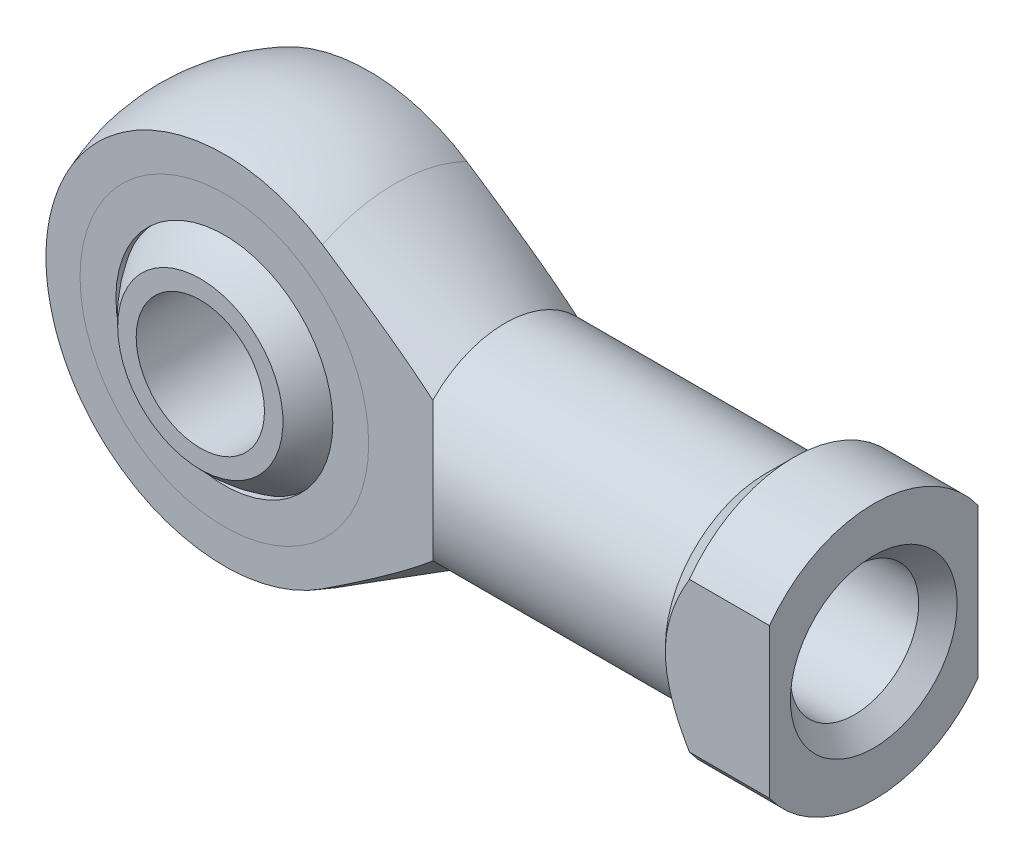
ISO-10303-21;
HEADER;
FILE_DESCRIPTION(('STEP AP214'),'2;1');
FILE_NAME('part.step','',(''),(''),'','','');
FILE_SCHEMA(('AUTOMOTIVE_DESIGN { 1 0 10303 214 1 1 1 1 }'));
ENDSEC;
DATA;
#1=APPLICATION_CONTEXT('core data for automotive mechanical design processes');
#2=APPLICATION_PROTOCOL_DEFINITION('international standard','automotive_design',2000,#1);
#3=PRODUCT_CONTEXT('',#1,'mechanical');
#4=PRODUCT('Part','Part','',(#3));
#5=PRODUCT_RELATED_PRODUCT_CATEGORY('part','',(#4));
#6=PRODUCT_DEFINITION_FORMATION('','',#4);
#7=PRODUCT_DEFINITION_CONTEXT('part definition',#1,'design');
#8=PRODUCT_DEFINITION('design','',#6,#7);
#9=PRODUCT_DEFINITION_SHAPE('','',#8);
#10=(LENGTH_UNIT() NAMED_UNIT(*) SI_UNIT(.MILLI.,.METRE.));
#11=(NAMED_UNIT(*) PLANE_ANGLE_UNIT() SI_UNIT($,.RADIAN.));
#12=(NAMED_UNIT(*) SI_UNIT($,.STERADIAN.) SOLID_ANGLE_UNIT());
#13=UNCERTAINTY_MEASURE_WITH_UNIT(LENGTH_MEASURE(1.E-05),#10,'distance_accuracy_value','');
#14=(GEOMETRIC_REPRESENTATION_CONTEXT(3) GLOBAL_UNCERTAINTY_ASSIGNED_CONTEXT((#13)) GLOBAL_UNIT_ASSIGNED_CONTEXT((#10,
#11,#12)) REPRESENTATION_CONTEXT('',''));
#15=CARTESIAN_POINT('',(0.,0.,0.));
#16=DIRECTION('',(0.,0.,1.));
#17=DIRECTION('',(1.,0.,0.));
#18=AXIS2_PLACEMENT_3D('',#15,#16,#17);
#19=CARTESIAN_POINT('',(0.,0.,0.));
#20=DIRECTION('',(0.,1.,0.));
#21=DIRECTION('',(1.,0.,0.));
#22=AXIS2_PLACEMENT_3D('',#19,#20,#21);
#23=SPHERICAL_SURFACE('',#22,7.91);
#24=CARTESIAN_POINT('',(0.,0.,0.));
#25=DIRECTION('',(0.,0.,-1.));
#26=DIRECTION('',(-1.,0.,0.));
#27=AXIS2_PLACEMENT_3D('',#24,#25,#26);
#28=SPHERICAL_SURFACE('',#27,7.91);
#29=CARTESIAN_POINT('',(0.,0.,6.));
#30=DIRECTION('',(0.,0.,-1.));
#31=DIRECTION('',(-1.,0.,0.));
#32=AXIS2_PLACEMENT_3D('',#29,#30,#31);
#33=CIRCLE('',#32,5.15442528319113);
#34=CARTESIAN_POINT('',(-5.15442528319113,0.,6.));
#35=VERTEX_POINT('',#34);
#36=EDGE_CURVE('P0_E26',#35,#35,#33,.F.);
#37=ORIENTED_EDGE('',*,*,#36,.F.);
#38=EDGE_LOOP('',(#37));
#39=FACE_BOUND('',#38,.T.);
#40=CARTESIAN_POINT('',(0.,0.,-6.));
#41=DIRECTION('',(0.,0.,1.));
#42=DIRECTION('',(1.,0.,0.));
#43=AXIS2_PLACEMENT_3D('',#40,#41,#42);
#44=CIRCLE('',#43,5.15442528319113);
#45=CARTESIAN_POINT('',(5.15442528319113,0.,-6.));
#46=VERTEX_POINT('',#45);
#47=EDGE_CURVE('P0_E10',#46,#46,#44,.F.);
#48=ORIENTED_EDGE('',*,*,#47,.F.);
#49=EDGE_LOOP('',(#48));
#50=FACE_BOUND('',#49,.T.);
#51=ADVANCED_FACE('P0_F14',(#39,#50),#28,.T.);
#52=CARTESIAN_POINT('',(0.,0.,-7.91));
#53=DIRECTION('',(0.,0.,1.));
#54=DIRECTION('',(1.,0.,0.));
#55=AXIS2_PLACEMENT_3D('',#52,#53,#54);
#56=CYLINDRICAL_SURFACE('',#55,4.);
#57=CARTESIAN_POINT('',(0.,0.,6.));
#58=DIRECTION('',(0.,0.,-1.));
#59=DIRECTION('',(-1.,0.,0.));
#60=AXIS2_PLACEMENT_3D('',#57,#58,#59);
#61=CIRCLE('',#60,4.);
#62=CARTESIAN_POINT('',(-4.,0.,6.));
#63=VERTEX_POINT('',#62);
#64=EDGE_CURVE('P0_E17',#63,#63,#61,.F.);
#65=ORIENTED_EDGE('',*,*,#64,.T.);
#66=EDGE_LOOP('',(#65));
#67=FACE_BOUND('',#66,.T.);
#68=CARTESIAN_POINT('',(0.,0.,-6.));
#69=DIRECTION('',(0.,0.,1.));
#70=DIRECTION('',(1.,0.,0.));
#71=AXIS2_PLACEMENT_3D('',#68,#69,#70);
#72=CIRCLE('',#71,4.);
#73=CARTESIAN_POINT('',(4.,0.,-6.));
#74=VERTEX_POINT('',#73);
#75=EDGE_CURVE('P0_E21',#74,#74,#72,.F.);
#76=ORIENTED_EDGE('',*,*,#75,.T.);
#77=EDGE_LOOP('',(#76));
#78=FACE_BOUND('',#77,.T.);
#79=ADVANCED_FACE('P0_F34',(#67,#78),#56,.F.);
#80=CARTESIAN_POINT('',(-7.91,-7.91,-6.));
#81=DIRECTION('',(0.,0.,1.));
#82=DIRECTION('',(1.,0.,0.));
#83=AXIS2_PLACEMENT_3D('',#80,#81,#82);
#84=PLANE('',#83);
#85=ORIENTED_EDGE('',*,*,#47,.T.);
#86=EDGE_LOOP('',(#85));
#87=FACE_BOUND('',#86,.T.);
#88=ORIENTED_EDGE('',*,*,#75,.F.);
#89=EDGE_LOOP('',(#88));
#90=FACE_BOUND('',#89,.T.);
#91=ADVANCED_FACE('P0_F39',(#87,#90),#84,.F.);
#92=CARTESIAN_POINT('',(-7.91,-7.91,6.));
#93=DIRECTION('',(0.,0.,-1.));
#94=DIRECTION('',(-1.,0.,0.));
#95=AXIS2_PLACEMENT_3D('',#92,#93,#94);
#96=PLANE('',#95);
#97=ORIENTED_EDGE('',*,*,#36,.T.);
#98=EDGE_LOOP('',(#97));
#99=FACE_BOUND('',#98,.T.);
#100=ORIENTED_EDGE('',*,*,#64,.F.);
#101=EDGE_LOOP('',(#100));
#102=FACE_BOUND('',#101,.T.);
#103=ADVANCED_FACE('P0_F37',(#99,#102),#96,.F.);
#104=CLOSED_SHELL('',(#51,#79,#91,#103));
#105=MANIFOLD_SOLID_BREP('P0_B1',#104);
#106=CARTESIAN_POINT('',(0.,0.,4.5));
#107=DIRECTION('',(0.,0.,1.));
#108=DIRECTION('',(1.,0.,0.));
#109=AXIS2_PLACEMENT_3D('',#106,#107,#108);
#110=PLANE('',#109);
#111=CARTESIAN_POINT('',(0.,0.,4.5));
#112=DIRECTION('',(0.,0.,1.));
#113=DIRECTION('',(1.,0.,0.));
#114=AXIS2_PLACEMENT_3D('',#111,#112,#113);
#115=CIRCLE('',#114,9.);
#116=CARTESIAN_POINT('',(9.,0.,4.5));
#117=VERTEX_POINT('',#116);
#118=EDGE_CURVE('P1_E10',#117,#117,#115,.T.);
#119=ORIENTED_EDGE('',*,*,#118,.T.);
#120=EDGE_LOOP('',(#119));
#121=FACE_BOUND('',#120,.T.);
#122=CARTESIAN_POINT('',(0.,0.,4.5));
#123=DIRECTION('',(0.,0.,1.));
#124=DIRECTION('',(1.,0.,0.));
#125=AXIS2_PLACEMENT_3D('',#122,#123,#124);
#126=CIRCLE('',#125,6.765);
#127=CARTESIAN_POINT('',(6.765,0.,4.5));
#128=VERTEX_POINT('',#127);
#129=EDGE_CURVE('P1_E25',#128,#128,#126,.T.);
#130=ORIENTED_EDGE('',*,*,#129,.F.);
#131=EDGE_LOOP('',(#130));
#132=FACE_BOUND('',#131,.T.);
#133=ADVANCED_FACE('P1_F14',(#121,#132),#110,.T.);
#134=CARTESIAN_POINT('',(0.,0.,4.1));
#135=DIRECTION('',(0.,0.,1.));
#136=DIRECTION('',(1.,0.,0.));
#137=AXIS2_PLACEMENT_3D('',#134,#135,#136);
#138=PLANE('',#137);
#139=CARTESIAN_POINT('',(0.,0.,4.1));
#140=DIRECTION('',(0.,0.,1.));
#141=DIRECTION('',(1.,0.,0.));
#142=AXIS2_PLACEMENT_3D('',#139,#140,#141);
#143=CIRCLE('',#142,9.);
#144=CARTESIAN_POINT('',(9.,0.,4.1));
#145=VERTEX_POINT('',#144);
#146=EDGE_CURVE('P1_E18',#145,#145,#143,.T.);
#147=ORIENTED_EDGE('',*,*,#146,.F.);
#148=EDGE_LOOP('',(#147));
#149=FACE_BOUND('',#148,.T.);
#150=CARTESIAN_POINT('',(0.,0.,4.1));
#151=DIRECTION('',(0.,0.,1.));
#152=DIRECTION('',(1.,0.,0.));
#153=AXIS2_PLACEMENT_3D('',#150,#151,#152);
#154=CIRCLE('',#153,6.765);
#155=CARTESIAN_POINT('',(6.765,0.,4.1));
#156=VERTEX_POINT('',#155);
#157=EDGE_CURVE('P1_E27',#156,#156,#154,.T.);
#158=ORIENTED_EDGE('',*,*,#157,.T.);
#159=EDGE_LOOP('',(#158));
#160=FACE_BOUND('',#159,.T.);
#161=ADVANCED_FACE('P1_F37',(#149,#160),#138,.F.);
#162=CARTESIAN_POINT('',(0.,0.,4.5));
#163=DIRECTION('',(0.,0.,-1.));
#164=DIRECTION('',(-1.,0.,0.));
#165=AXIS2_PLACEMENT_3D('',#162,#163,#164);
#166=CYLINDRICAL_SURFACE('',#165,9.);
#167=ORIENTED_EDGE('',*,*,#118,.F.);
#168=EDGE_LOOP('',(#167));
#169=FACE_BOUND('',#168,.T.);
#170=ORIENTED_EDGE('',*,*,#146,.T.);
#171=EDGE_LOOP('',(#170));
#172=FACE_BOUND('',#171,.T.);
#173=ADVANCED_FACE('P1_F16',(#169,#172),#166,.T.);
#174=CARTESIAN_POINT('',(0.,0.,4.5));
#175=DIRECTION('',(0.,0.,-1.));
#176=DIRECTION('',(-1.,0.,0.));
#177=AXIS2_PLACEMENT_3D('',#174,#175,#176);
#178=CYLINDRICAL_SURFACE('',#177,6.765);
#179=ORIENTED_EDGE('',*,*,#129,.T.);
#180=EDGE_LOOP('',(#179));
#181=FACE_BOUND('',#180,.T.);
#182=ORIENTED_EDGE('',*,*,#157,.F.);
#183=EDGE_LOOP('',(#182));
#184=FACE_BOUND('',#183,.T.);
#185=ADVANCED_FACE('P1_F33',(#181,#184),#178,.F.);
#186=CLOSED_SHELL('',(#133,#161,#173,#185));
#187=MANIFOLD_SOLID_BREP('P1_B1',#186);
#188=CARTESIAN_POINT('',(0.,0.,-4.1));
#189=DIRECTION('',(0.,0.,1.));
#190=DIRECTION('',(1.,0.,0.));
#191=AXIS2_PLACEMENT_3D('',#188,#189,#190);
#192=PLANE('',#191);
#193=CARTESIAN_POINT('',(0.,0.,-4.1));
#194=DIRECTION('',(0.,0.,1.));
#195=DIRECTION('',(1.,0.,0.));
#196=AXIS2_PLACEMENT_3D('',#193,#194,#195);
#197=CIRCLE('',#196,9.);
#198=CARTESIAN_POINT('',(9.,0.,-4.1));
#199=VERTEX_POINT('',#198);
#200=EDGE_CURVE('P2_E10',#199,#199,#197,.T.);
#201=ORIENTED_EDGE('',*,*,#200,.T.);
#202=EDGE_LOOP('',(#201));
#203=FACE_BOUND('',#202,.T.);
#204=CARTESIAN_POINT('',(0.,0.,-4.1));
#205=DIRECTION('',(0.,0.,1.));
#206=DIRECTION('',(1.,0.,0.));
#207=AXIS2_PLACEMENT_3D('',#204,#205,#206);
#208=CIRCLE('',#207,6.765);
#209=CARTESIAN_POINT('',(6.765,0.,-4.1));
#210=VERTEX_POINT('',#209);
#211=EDGE_CURVE('P2_E25',#210,#210,#208,.T.);
#212=ORIENTED_EDGE('',*,*,#211,.F.);
#213=EDGE_LOOP('',(#212));
#214=FACE_BOUND('',#213,.T.);
#215=ADVANCED_FACE('P2_F14',(#203,#214),#192,.T.);
#216=CARTESIAN_POINT('',(0.,0.,-4.5));
#217=DIRECTION('',(0.,0.,1.));
#218=DIRECTION('',(1.,0.,0.));
#219=AXIS2_PLACEMENT_3D('',#216,#217,#218);
#220=PLANE('',#219);
#221=CARTESIAN_POINT('',(0.,0.,-4.5));
#222=DIRECTION('',(0.,0.,1.));
#223=DIRECTION('',(1.,0.,0.));
#224=AXIS2_PLACEMENT_3D('',#221,#222,#223);
#225=CIRCLE('',#224,9.);
#226=CARTESIAN_POINT('',(9.,0.,-4.5));
#227=VERTEX_POINT('',#226);
#228=EDGE_CURVE('P2_E18',#227,#227,#225,.T.);
#229=ORIENTED_EDGE('',*,*,#228,.F.);
#230=EDGE_LOOP('',(#229));
#231=FACE_BOUND('',#230,.T.);
#232=CARTESIAN_POINT('',(0.,0.,-4.5));
#233=DIRECTION('',(0.,0.,1.));
#234=DIRECTION('',(1.,0.,0.));
#235=AXIS2_PLACEMENT_3D('',#232,#233,#234);
#236=CIRCLE('',#235,6.765);
#237=CARTESIAN_POINT('',(6.765,0.,-4.5));
#238=VERTEX_POINT('',#237);
#239=EDGE_CURVE('P2_E27',#238,#238,#236,.T.);
#240=ORIENTED_EDGE('',*,*,#239,.T.);
#241=EDGE_LOOP('',(#240));
#242=FACE_BOUND('',#241,.T.);
#243=ADVANCED_FACE('P2_F37',(#231,#242),#220,.F.);
#244=CARTESIAN_POINT('',(0.,0.,-4.1));
#245=DIRECTION('',(0.,0.,-1.));
#246=DIRECTION('',(-1.,0.,0.));
#247=AXIS2_PLACEMENT_3D('',#244,#245,#246);
#248=CYLINDRICAL_SURFACE('',#247,9.);
#249=ORIENTED_EDGE('',*,*,#200,.F.);
#250=EDGE_LOOP('',(#249));
#251=FACE_BOUND('',#250,.T.);
#252=ORIENTED_EDGE('',*,*,#228,.T.);
#253=EDGE_LOOP('',(#252));
#254=FACE_BOUND('',#253,.T.);
#255=ADVANCED_FACE('P2_F16',(#251,#254),#248,.T.);
#256=CARTESIAN_POINT('',(0.,0.,-4.1));
#257=DIRECTION('',(0.,0.,-1.));
#258=DIRECTION('',(-1.,0.,0.));
#259=AXIS2_PLACEMENT_3D('',#256,#257,#258);
#260=CYLINDRICAL_SURFACE('',#259,6.765);
#261=ORIENTED_EDGE('',*,*,#211,.T.);
#262=EDGE_LOOP('',(#261));
#263=FACE_BOUND('',#262,.T.);
#264=ORIENTED_EDGE('',*,*,#239,.F.);
#265=EDGE_LOOP('',(#264));
#266=FACE_BOUND('',#265,.T.);
#267=ADVANCED_FACE('P2_F33',(#263,#266),#260,.F.);
#268=CLOSED_SHELL('',(#215,#243,#255,#267));
#269=MANIFOLD_SOLID_BREP('P2_B1',#268);
#270=CARTESIAN_POINT('',(0.,0.,0.));
#271=DIRECTION('',(0.,1.,0.));
#272=DIRECTION('',(1.,0.,0.));
#273=AXIS2_PLACEMENT_3D('',#270,#271,#272);
#274=SPHERICAL_SURFACE('',#273,7.91);
#275=CARTESIAN_POINT('',(0.,0.,0.));
#276=DIRECTION('',(0.,0.,1.));
#277=DIRECTION('',(1.,0.,0.));
#278=AXIS2_PLACEMENT_3D('',#275,#276,#277);
#279=SPHERICAL_SURFACE('',#278,7.91);
#280=CARTESIAN_POINT('',(0.,0.,4.1));
#281=DIRECTION('',(0.,0.,1.));
#282=DIRECTION('',(1.,0.,0.));
#283=AXIS2_PLACEMENT_3D('',#280,#281,#282);
#284=CIRCLE('',#283,6.76447337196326);
#285=CARTESIAN_POINT('',(6.76447337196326,0.,4.1));
#286=VERTEX_POINT('',#285);
#287=EDGE_CURVE('P3_E73',#286,#286,#284,.F.);
#288=ORIENTED_EDGE('',*,*,#287,.F.);
#289=EDGE_LOOP('',(#288));
#290=FACE_BOUND('',#289,.T.);
#291=CARTESIAN_POINT('',(0.,0.,-4.1));
#292=DIRECTION('',(0.,0.,-1.));
#293=DIRECTION('',(-1.,0.,0.));
#294=AXIS2_PLACEMENT_3D('',#291,#292,#293);
#295=CIRCLE('',#294,6.76447337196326);
#296=CARTESIAN_POINT('',(-6.76447337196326,0.,-4.1));
#297=VERTEX_POINT('',#296);
#298=EDGE_CURVE('P3_E20',#297,#297,#295,.F.);
#299=ORIENTED_EDGE('',*,*,#298,.F.);
#300=EDGE_LOOP('',(#299));
#301=FACE_BOUND('',#300,.T.);
#302=ADVANCED_FACE('P3_F16',(#290,#301),#279,.F.);
#303=CARTESIAN_POINT('',(-13.,-12.,-4.5));
#304=DIRECTION('',(0.,0.,1.));
#305=DIRECTION('',(1.,0.,0.));
#306=AXIS2_PLACEMENT_3D('',#303,#304,#305);
#307=PLANE('',#306);
#308=CARTESIAN_POINT('',(0.,0.,-4.5));
#309=DIRECTION('',(0.,0.,1.));
#310=DIRECTION('',(1.,0.,0.));
#311=AXIS2_PLACEMENT_3D('',#308,#309,#310);
#312=CIRCLE('',#311,11.1242977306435);
#313=CARTESIAN_POINT('',(6.11213987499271,9.29471603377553,-4.5));
#314=VERTEX_POINT('',#313);
#315=CARTESIAN_POINT('',(6.11213987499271,-9.29471603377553,-4.5));
#316=VERTEX_POINT('',#315);
#317=EDGE_CURVE('P3_E11',#314,#316,#312,.T.);
#318=ORIENTED_EDGE('',*,*,#317,.F.);
#319=CARTESIAN_POINT('',(-20.2352938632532,-25.5275280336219,-4.5));
#320=CARTESIAN_POINT('',(-19.5086189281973,-25.090791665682,-4.5));
#321=CARTESIAN_POINT('',(-18.782089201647,-24.6538135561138,-4.5));
#322=CARTESIAN_POINT('',(-17.3293777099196,-23.7792739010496,-4.5));
#323=CARTESIAN_POINT('',(-16.6031959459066,-23.3417123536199,-4.5));
#324=CARTESIAN_POINT('',(-15.1503357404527,-22.4653616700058,-4.5));
#325=CARTESIAN_POINT('',(-14.4236578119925,-22.0265716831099,-4.5));
#326=CARTESIAN_POINT('',(-12.9707991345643,-21.1481745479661,-4.5));
#327=CARTESIAN_POINT('',(-12.2446183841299,-20.7085674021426,-4.5));
#328=CARTESIAN_POINT('',(-10.0379121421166,-19.3706882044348,-4.5));
#329=CARTESIAN_POINT('',(-8.55831168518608,-18.4708876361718,-4.5));
#330=CARTESIAN_POINT('',(-6.34263025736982,-17.117127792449,-4.5));
#331=CARTESIAN_POINT('',(-5.60513978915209,-16.6654756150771,-4.5));
#332=CARTESIAN_POINT('',(-4.13138529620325,-15.7602257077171,-4.5));
#333=CARTESIAN_POINT('',(-3.39512123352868,-15.3066280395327,-4.5));
#334=CARTESIAN_POINT('',(-1.92567681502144,-14.39785629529,-4.5));
#335=CARTESIAN_POINT('',(-1.19249323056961,-13.942687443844,-4.5));
#336=CARTESIAN_POINT('',(0.271890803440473,-13.0289773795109,-4.5));
#337=CARTESIAN_POINT('',(1.0030910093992,-12.5704357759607,-4.5));
#338=CARTESIAN_POINT('',(2.46542405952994,-11.6471033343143,-4.5));
#339=CARTESIAN_POINT('',(3.19654612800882,-11.182295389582,-4.5));
#340=CARTESIAN_POINT('',(4.28997441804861,-10.4803470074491,-4.5));
#341=CARTESIAN_POINT('',(4.65383249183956,-10.2456242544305,-4.5));
#342=CARTESIAN_POINT('',(5.38027392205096,-9.77421544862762,-4.5));
#343=CARTESIAN_POINT('',(5.74285728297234,-9.53752940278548,-4.5));
#344=CARTESIAN_POINT('',(6.46253334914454,-9.06432326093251,-4.5));
#345=CARTESIAN_POINT('',(6.81964304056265,-8.82782902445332,-4.5));
#346=CARTESIAN_POINT('',(7.53190534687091,-8.3519149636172,-4.5));
#347=CARTESIAN_POINT('',(7.8870579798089,-8.11249516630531,-4.5));
#348=CARTESIAN_POINT('',(8.59542745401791,-7.62955109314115,-4.5));
#349=CARTESIAN_POINT('',(8.94864012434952,-7.38602068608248,-4.5));
#350=CARTESIAN_POINT('',(9.65166576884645,-6.89417376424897,-4.5));
#351=CARTESIAN_POINT('',(10.0014791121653,-6.64585777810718,-4.5));
#352=CARTESIAN_POINT('',(10.6940209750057,-6.14464805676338,-4.5));
#353=CARTESIAN_POINT('',(11.0367823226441,-5.89179996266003,-4.5));
#354=CARTESIAN_POINT('',(11.5461062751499,-5.50598921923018,-4.5));
#355=CARTESIAN_POINT('',(11.7151196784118,-5.37626253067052,-4.5));
#356=CARTESIAN_POINT('',(12.0511318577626,-5.11422919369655,-4.5));
#357=CARTESIAN_POINT('',(12.2181306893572,-4.98192261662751,-4.5));
#358=CARTESIAN_POINT('',(12.549178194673,-4.71458584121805,-4.5));
#359=CARTESIAN_POINT('',(12.7132337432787,-4.57956417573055,-4.5));
#360=CARTESIAN_POINT('',(13.038199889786,-4.30579720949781,-4.5));
#361=CARTESIAN_POINT('',(13.1991107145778,-4.16705217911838,-4.5));
#362=CARTESIAN_POINT('',(13.516749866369,-3.88509225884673,-4.5));
#363=CARTESIAN_POINT('',(13.6734814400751,-3.74188103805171,-4.5));
#364=CARTESIAN_POINT('',(13.9815552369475,-3.44979564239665,-4.5));
#365=CARTESIAN_POINT('',(14.1328988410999,-3.30092293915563,-4.5));
#366=CARTESIAN_POINT('',(14.3425403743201,-3.0844692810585,-4.5));
#367=CARTESIAN_POINT('',(14.4038826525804,-3.01983113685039,-4.5));
#368=CARTESIAN_POINT('',(14.5250673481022,-2.88914463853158,-4.5));
#369=CARTESIAN_POINT('',(14.5849095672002,-2.82309610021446,-4.5));
#370=CARTESIAN_POINT('',(14.7028869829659,-2.68940744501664,-4.5));
#371=CARTESIAN_POINT('',(14.7610210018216,-2.62176628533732,-4.5));
#372=CARTESIAN_POINT('',(14.8752364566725,-2.48477801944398,-4.5));
#373=CARTESIAN_POINT('',(14.9313179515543,-2.4154309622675,-4.5));
#374=CARTESIAN_POINT('',(15.0952604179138,-2.20548758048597,-4.5));
#375=CARTESIAN_POINT('',(15.1996112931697,-2.0621056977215,-4.5));
#376=CARTESIAN_POINT('',(15.3950524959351,-1.76658522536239,-4.5));
#377=CARTESIAN_POINT('',(15.4861580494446,-1.61445697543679,-4.5));
#378=CARTESIAN_POINT('',(15.6074168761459,-1.38150946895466,-4.5));
#379=CARTESIAN_POINT('',(15.6447557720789,-1.30442147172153,-4.5));
#380=CARTESIAN_POINT('',(15.7142637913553,-1.14793669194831,-4.5));
#381=CARTESIAN_POINT('',(15.7464334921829,-1.06854016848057,-4.5));
#382=CARTESIAN_POINT('',(15.8047575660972,-0.907569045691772,-4.5));
#383=CARTESIAN_POINT('',(15.8309132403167,-0.825994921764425,-4.5));
#384=CARTESIAN_POINT('',(15.8763629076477,-0.660961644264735,-4.5));
#385=CARTESIAN_POINT('',(15.895658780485,-0.577503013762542,-4.5));
#386=CARTESIAN_POINT('',(15.9268312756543,-0.408190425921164,-4.5));
#387=CARTESIAN_POINT('',(15.9386190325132,-0.322319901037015,-4.5));
#388=CARTESIAN_POINT('',(15.9538850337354,-0.149841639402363,-4.5));
#389=CARTESIAN_POINT('',(15.9573639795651,-0.0632339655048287,-4.5));
#390=CARTESIAN_POINT('',(15.9558471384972,0.109879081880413,-4.5));
#391=CARTESIAN_POINT('',(15.9508540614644,0.196384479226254,-4.5));
#392=CARTESIAN_POINT('',(15.9326370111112,0.368521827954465,-4.5));
#393=CARTESIAN_POINT('',(15.9194119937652,0.454153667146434,-4.5));
#394=CARTESIAN_POINT('',(15.8833878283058,0.633433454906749,-4.5));
#395=CARTESIAN_POINT('',(15.8596777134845,0.726897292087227,-4.5));
#396=CARTESIAN_POINT('',(15.8038885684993,0.911301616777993,-4.5));
#397=CARTESIAN_POINT('',(15.7718057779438,1.00224095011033,-4.5));
#398=CARTESIAN_POINT('',(15.7004308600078,1.18142317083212,-4.5));
#399=CARTESIAN_POINT('',(15.6611246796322,1.2696604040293,-4.5));
#400=CARTESIAN_POINT('',(15.5765156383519,1.4431816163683,-4.5));
#401=CARTESIAN_POINT('',(15.5312128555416,1.52846563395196,-4.5));
#402=CARTESIAN_POINT('',(15.426729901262,1.71181042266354,-4.5));
#403=CARTESIAN_POINT('',(15.3665367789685,1.80929116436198,-4.5));
#404=CARTESIAN_POINT('',(15.2405476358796,2.00058099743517,-4.5));
#405=CARTESIAN_POINT('',(15.1747494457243,2.09438864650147,-4.5));
#406=CARTESIAN_POINT('',(15.0385714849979,2.27881281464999,-4.5));
#407=CARTESIAN_POINT('',(14.9681850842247,2.36942441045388,-4.5));
#408=CARTESIAN_POINT('',(14.8237698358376,2.54770069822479,-4.5));
#409=CARTESIAN_POINT('',(14.7497405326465,2.63536501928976,-4.5));
#410=CARTESIAN_POINT('',(14.5981772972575,2.80870025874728,-4.5));
#411=CARTESIAN_POINT('',(14.5206222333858,2.89435263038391,-4.5));
#412=CARTESIAN_POINT('',(14.363027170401,3.06333638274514,-4.5));
#413=CARTESIAN_POINT('',(14.2829871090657,3.14666770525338,-4.5));
#414=CARTESIAN_POINT('',(14.1209191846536,3.31120481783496,-4.5));
#415=CARTESIAN_POINT('',(14.0388933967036,3.3924126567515,-4.5));
#416=CARTESIAN_POINT('',(13.8731044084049,3.55302398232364,-4.5));
#417=CARTESIAN_POINT('',(13.789341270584,3.63242753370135,-4.5));
#418=CARTESIAN_POINT('',(13.5207556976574,3.88229908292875,-4.5));
#419=CARTESIAN_POINT('',(13.3331730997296,4.04980318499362,-4.5));
#420=CARTESIAN_POINT('',(12.9529625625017,4.37900285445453,-4.5));
#421=CARTESIAN_POINT('',(12.7603337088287,4.54069735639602,-4.5));
#422=CARTESIAN_POINT('',(12.3711957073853,4.85956131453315,-4.5));
#423=CARTESIAN_POINT('',(12.1746844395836,5.01672817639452,-4.5));
#424=CARTESIAN_POINT('',(11.7787476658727,5.32735521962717,-4.5));
#425=CARTESIAN_POINT('',(11.5793220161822,5.48081521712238,-4.5));
#426=CARTESIAN_POINT('',(11.1777374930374,5.78504017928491,-4.5));
#427=CARTESIAN_POINT('',(10.9755735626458,5.93579845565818,-4.5));
#428=CARTESIAN_POINT('',(10.5693901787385,6.23479712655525,-4.5));
#429=CARTESIAN_POINT('',(10.3653706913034,6.38303747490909,-4.5));
#430=CARTESIAN_POINT('',(9.75120276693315,6.82451466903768,-4.5));
#431=CARTESIAN_POINT('',(9.33880075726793,7.1146157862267,-4.5));
#432=CARTESIAN_POINT('',(8.50986281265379,7.68878498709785,-4.5));
#433=CARTESIAN_POINT('',(8.09332703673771,7.9728533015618,-4.5));
#434=CARTESIAN_POINT('',(7.25718614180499,8.53650256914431,-4.5));
#435=CARTESIAN_POINT('',(6.83758077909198,8.81608316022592,-4.5));
#436=CARTESIAN_POINT('',(5.99667264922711,9.37139462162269,-4.5));
#437=CARTESIAN_POINT('',(5.57537305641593,9.64713030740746,-4.5));
#438=CARTESIAN_POINT('',(4.73102363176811,10.1958790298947,-4.5));
#439=CARTESIAN_POINT('',(4.30797385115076,10.468892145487,-4.5));
#440=CARTESIAN_POINT('',(3.45962637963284,11.0132944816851,-4.5));
#441=CARTESIAN_POINT('',(3.03432587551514,11.2846793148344,-4.5));
#442=CARTESIAN_POINT('',(2.18259597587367,11.8256723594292,-4.5));
#443=CARTESIAN_POINT('',(1.75616657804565,12.0952805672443,-4.5));
#444=CARTESIAN_POINT('',(0.475497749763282,12.9019293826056,-4.5));
#445=CARTESIAN_POINT('',(-0.380114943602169,13.4367894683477,-4.5));
#446=CARTESIAN_POINT('',(-2.09390633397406,14.5024561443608,-4.5));
#447=CARTESIAN_POINT('',(-2.95208513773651,15.0332625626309,-4.5));
#448=CARTESIAN_POINT('',(-4.67028765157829,16.0918828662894,-4.5));
#449=CARTESIAN_POINT('',(-5.53031136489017,16.6196967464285,-4.5));
#450=CARTESIAN_POINT('',(-7.2523839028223,17.6734638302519,-4.5));
#451=CARTESIAN_POINT('',(-8.11443376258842,18.1994153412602,-4.5));
#452=CARTESIAN_POINT('',(-9.83960022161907,19.2495674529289,-4.5));
#453=CARTESIAN_POINT('',(-10.7027168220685,19.7737680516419,-4.5));
#454=CARTESIAN_POINT('',(-13.2932680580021,21.3442939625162,-4.5));
#455=CARTESIAN_POINT('',(-15.0219456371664,22.3885687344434,-4.5));
#456=CARTESIAN_POINT('',(-18.4442771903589,24.4511610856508,-4.5));
#457=CARTESIAN_POINT('',(-20.137885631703,25.4695542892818,-4.5));
#458=CARTESIAN_POINT('',(-23.5265504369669,27.5039576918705,-4.5));
#459=CARTESIAN_POINT('',(-25.2216068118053,28.5199678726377,-4.5));
#460=CARTESIAN_POINT('',(-28.6112313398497,30.5493552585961,-4.5));
#461=CARTESIAN_POINT('',(-30.3057985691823,31.5627340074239,-4.5));
#462=CARTESIAN_POINT('',(-33.6957039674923,33.5881680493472,-4.5));
#463=CARTESIAN_POINT('',(-35.3910421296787,34.6002233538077,-4.5));
#464=CARTESIAN_POINT('',(-37.0866511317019,35.611824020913,-4.5));
#465=B_SPLINE_CURVE_WITH_KNOTS('',3,(#319,#320,#321,#322,#323,#324,#325,#326,#327,#328,#329,
#330,#331,#332,#333,#334,#335,#336,#337,#338,#339,#340,#341,#342,#343,#344,#345,#346,#347,#348,
#349,#350,#351,#352,#353,#354,#355,#356,#357,#358,#359,#360,#361,#362,#363,#364,#365,#366,#367,
#368,#369,#370,#371,#372,#373,#374,#375,#376,#377,#378,#379,#380,#381,#382,#383,#384,#385,#386,
#387,#388,#389,#390,#391,#392,#393,#394,#395,#396,#397,#398,#399,#400,#401,#402,#403,#404,#405,
#406,#407,#408,#409,#410,#411,#412,#413,#414,#415,#416,#417,#418,#419,#420,#421,#422,#423,#424,
#425,#426,#427,#428,#429,#430,#431,#432,#433,#434,#435,#436,#437,#438,#439,#440,#441,#442,#443,
#444,#445,#446,#447,#448,#449,#450,#451,#452,#453,#454,#455,#456,#457,#458,#459,#460,#461,#462,
#463,#464),.UNSPECIFIED.,.F.,.F.,(4,2,2,2,2,2,2,2,2,2,2,2,2,2,2,2,2,2,2,2,2,2,2,2,2,2,2,2,2,2,2,
2,2,2,2,2,2,2,2,2,2,2,2,2,2,2,2,2,2,2,2,2,2,2,2,2,2,2,2,2,2,2,2,2,2,2,2,2,2,2,2,2,4),(0.,
2.54345360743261,5.0869156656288,7.63355544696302,10.1801876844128,15.3753392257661,
17.9697419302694,20.5640628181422,23.1530000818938,25.7422420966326,28.3413053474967,
29.6402952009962,30.9392804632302,32.2242249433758,33.5091575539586,34.7962144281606,
36.0831299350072,37.3608098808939,37.9999703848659,38.6391132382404,39.2764906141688,
39.9138218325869,40.5506425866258,41.1872989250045,41.4546162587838,41.7219687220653,
41.989501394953,42.2570263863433,42.7885240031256,43.31940572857,43.5762184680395,
43.8330024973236,44.0897309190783,44.3463889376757,44.6060309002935,44.8656509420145,
45.1251879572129,45.3847578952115,45.673578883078,45.9625298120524,46.2520489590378,
46.5415643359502,46.8850214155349,47.2286120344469,47.5727106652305,47.9168524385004,
48.2634349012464,48.6100260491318,48.956269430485,49.3025003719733,50.0567743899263,
50.8111860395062,51.5660216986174,52.3208947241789,53.077432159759,53.8339834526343,
55.3465456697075,56.8590499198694,58.3716755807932,59.8821964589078,61.3926734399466,
62.9061978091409,64.4197252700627,67.446806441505,70.4740153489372,73.5012295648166,
76.5307145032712,79.5602028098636,85.6190335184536,91.5476828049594,97.4763772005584,
103.399758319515,109.323088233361),.UNSPECIFIED.);
#466=CARTESIAN_POINT('',(13.,4.33733789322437,-4.5));
#467=VERTEX_POINT('',#466);
#468=EDGE_CURVE('P3_E102',#467,#314,#465,.T.);
#469=ORIENTED_EDGE('',*,*,#468,.F.);
#470=DIRECTION('',(0.,1.,0.));
#471=VECTOR('',#470,1.);
#472=CARTESIAN_POINT('',(13.,-12.,-4.5));
#473=LINE('',#472,#471);
#474=CARTESIAN_POINT('',(13.,-4.33733789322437,-4.5));
#475=VERTEX_POINT('',#474);
#476=EDGE_CURVE('P3_E64',#475,#467,#473,.T.);
#477=ORIENTED_EDGE('',*,*,#476,.F.);
#478=EDGE_CURVE('P3_E33',#316,#475,#465,.T.);
#479=ORIENTED_EDGE('',*,*,#478,.F.);
#480=EDGE_LOOP('',(#318,#469,#477,#479));
#481=FACE_BOUND('',#480,.T.);
#482=CARTESIAN_POINT('',(0.,0.,-4.5));
#483=DIRECTION('',(0.,0.,1.));
#484=DIRECTION('',(1.,0.,0.));
#485=AXIS2_PLACEMENT_3D('',#482,#483,#484);
#486=CIRCLE('',#485,9.);
#487=CARTESIAN_POINT('',(9.,0.,-4.5));
#488=VERTEX_POINT('',#487);
#489=EDGE_CURVE('P3_E95',#488,#488,#486,.T.);
#490=ORIENTED_EDGE('',*,*,#489,.T.);
#491=EDGE_LOOP('',(#490));
#492=FACE_BOUND('',#491,.T.);
#493=ADVANCED_FACE('P3_F125',(#481,#492),#307,.F.);
#494=CARTESIAN_POINT('',(13.,0.,0.));
#495=DIRECTION('',(-1.,0.,0.));
#496=DIRECTION('',(0.,0.,1.));
#497=AXIS2_PLACEMENT_3D('',#494,#495,#496);
#498=CONICAL_SURFACE('',#497,6.25,0.534423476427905);
#499=CARTESIAN_POINT('',(6.11213987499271,0.,0.));
#500=DIRECTION('',(-1.,0.,0.));
#501=DIRECTION('',(0.,0.,1.));
#502=AXIS2_PLACEMENT_3D('',#499,#500,#501);
#503=CIRCLE('',#502,10.3267490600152);
#504=CARTESIAN_POINT('',(6.11213987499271,-9.29471603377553,4.5));
#505=VERTEX_POINT('',#504);
#506=EDGE_CURVE('P3_E79',#316,#505,#503,.T.);
#507=ORIENTED_EDGE('',*,*,#506,.F.);
#508=ORIENTED_EDGE('',*,*,#478,.T.);
#509=CARTESIAN_POINT('',(13.,0.,0.));
#510=DIRECTION('',(-1.,0.,0.));
#511=DIRECTION('',(0.,0.,1.));
#512=AXIS2_PLACEMENT_3D('',#509,#510,#511);
#513=CIRCLE('',#512,6.25);
#514=CARTESIAN_POINT('',(13.,-4.33733789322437,4.5));
#515=VERTEX_POINT('',#514);
#516=EDGE_CURVE('P3_E70',#475,#515,#513,.T.);
#517=ORIENTED_EDGE('',*,*,#516,.T.);
#518=CARTESIAN_POINT('',(-24.5319135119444,-28.1062231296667,4.5));
#519=CARTESIAN_POINT('',(-23.7285088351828,-27.6246491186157,4.5));
#520=CARTESIAN_POINT('',(-22.9252376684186,-27.1428523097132,4.5));
#521=CARTESIAN_POINT('',(-21.3190143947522,-26.1787237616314,4.5));
#522=CARTESIAN_POINT('',(-20.5160622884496,-25.6963920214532,4.5));
#523=CARTESIAN_POINT('',(-18.1066049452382,-24.2477643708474,4.5));
#524=CARTESIAN_POINT('',(-16.5006619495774,-23.2805329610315,4.5));
#525=CARTESIAN_POINT('',(-13.2792467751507,-21.335480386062,4.5));
#526=CARTESIAN_POINT('',(-11.6637901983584,-20.3576333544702,4.5));
#527=CARTESIAN_POINT('',(-9.24367121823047,-18.887093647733,4.5));
#528=CARTESIAN_POINT('',(-8.43775866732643,-18.3964587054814,4.5));
#529=CARTESIAN_POINT('',(-6.82701113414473,-17.4134530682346,4.5));
#530=CARTESIAN_POINT('',(-6.02217613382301,-16.9210824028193,4.5));
#531=CARTESIAN_POINT('',(-4.41483449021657,-15.9346906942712,4.5));
#532=CARTESIAN_POINT('',(-3.61232621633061,-15.4406723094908,4.5));
#533=CARTESIAN_POINT('',(-2.00907193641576,-14.4496680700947,4.5));
#534=CARTESIAN_POINT('',(-1.20832604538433,-13.9526820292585,4.5));
#535=CARTESIAN_POINT('',(0.392416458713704,-12.9536511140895,4.5));
#536=CARTESIAN_POINT('',(1.19240769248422,-12.4515976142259,4.5));
#537=CARTESIAN_POINT('',(2.78868727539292,-11.4420196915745,4.5));
#538=CARTESIAN_POINT('',(3.58497642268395,-10.9344965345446,4.5));
#539=CARTESIAN_POINT('',(4.77465064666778,-10.1675156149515,4.5));
#540=CARTESIAN_POINT('',(5.17003353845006,-9.91115783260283,4.5));
#541=CARTESIAN_POINT('',(5.95911940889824,-9.39587175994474,4.5));
#542=CARTESIAN_POINT('',(6.352822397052,-9.13694348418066,4.5));
#543=CARTESIAN_POINT('',(7.13843630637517,-8.61562008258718,4.5));
#544=CARTESIAN_POINT('',(7.53034531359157,-8.35322206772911,4.5));
#545=CARTESIAN_POINT('',(8.31131887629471,-7.82426811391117,4.5));
#546=CARTESIAN_POINT('',(8.70038359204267,-7.55771241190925,4.5));
#547=CARTESIAN_POINT('',(9.47309594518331,-7.02022732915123,4.5));
#548=CARTESIAN_POINT('',(9.85675939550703,-6.74932078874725,4.5));
#549=CARTESIAN_POINT('',(10.4282909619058,-6.33735599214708,4.5));
#550=CARTESIAN_POINT('',(10.6181656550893,-6.19908162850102,4.5));
#551=CARTESIAN_POINT('',(10.9962852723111,-5.92032442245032,4.5));
#552=CARTESIAN_POINT('',(11.1845302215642,-5.779841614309,4.5));
#553=CARTESIAN_POINT('',(11.558747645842,-5.49645222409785,4.5));
#554=CARTESIAN_POINT('',(11.7447230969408,-5.35354957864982,4.5));
#555=CARTESIAN_POINT('',(12.1141899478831,-5.06457436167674,4.5));
#556=CARTESIAN_POINT('',(12.2976814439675,-4.91850191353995,4.5));
#557=CARTESIAN_POINT('',(12.6614339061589,-4.62253441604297,4.5));
#558=CARTESIAN_POINT('',(12.8416962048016,-4.47264100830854,4.5));
#559=CARTESIAN_POINT('',(13.1981063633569,-4.16805351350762,4.5));
#560=CARTESIAN_POINT('',(13.3742547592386,-4.01336005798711,4.5));
#561=CARTESIAN_POINT('',(13.6357365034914,-3.77548844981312,4.5));
#562=CARTESIAN_POINT('',(13.7231200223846,-3.69456231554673,4.5));
#563=CARTESIAN_POINT('',(13.8962116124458,-3.53091900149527,4.5));
#564=CARTESIAN_POINT('',(13.9819195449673,-3.44820167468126,4.5));
#565=CARTESIAN_POINT('',(14.151420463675,-3.28066105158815,4.5));
#566=CARTESIAN_POINT('',(14.2352115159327,-3.19583579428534,4.5));
#567=CARTESIAN_POINT('',(14.4003899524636,-3.02387435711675,4.5));
#568=CARTESIAN_POINT('',(14.4817774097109,-2.93673824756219,4.5));
#569=CARTESIAN_POINT('',(14.6410419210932,-2.76048435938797,4.5));
#570=CARTESIAN_POINT('',(14.7189406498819,-2.67138623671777,4.5));
#571=CARTESIAN_POINT('',(14.8712123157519,-2.49022998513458,4.5));
#572=CARTESIAN_POINT('',(14.9455856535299,-2.39817219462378,4.5));
#573=CARTESIAN_POINT('',(15.0898744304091,-2.21080963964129,4.5));
#574=CARTESIAN_POINT('',(15.1597958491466,-2.11550950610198,4.5));
#575=CARTESIAN_POINT('',(15.2941773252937,-1.92115767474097,4.5));
#576=CARTESIAN_POINT('',(15.358639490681,-1.8221074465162,4.5));
#577=CARTESIAN_POINT('',(15.467059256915,-1.64245219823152,4.5));
#578=CARTESIAN_POINT('',(15.5123786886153,-1.56267528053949,4.5));
#579=CARTESIAN_POINT('',(15.5980605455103,-1.40052792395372,4.5));
#580=CARTESIAN_POINT('',(15.6384228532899,-1.31815742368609,4.5));
#581=CARTESIAN_POINT('',(15.7505940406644,-1.06711057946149,4.5));
#582=CARTESIAN_POINT('',(15.8136604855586,-0.89422327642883,4.5));
#583=CARTESIAN_POINT('',(15.8807025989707,-0.642196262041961,4.5));
#584=CARTESIAN_POINT('',(15.8977890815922,-0.56642976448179,4.5));
#585=CARTESIAN_POINT('',(15.9257093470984,-0.413766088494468,4.5));
#586=CARTESIAN_POINT('',(15.9365462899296,-0.336869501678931,4.5));
#587=CARTESIAN_POINT('',(15.9515750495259,-0.182456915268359,4.5));
#588=CARTESIAN_POINT('',(15.9557694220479,-0.104941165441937,4.5));
#589=CARTESIAN_POINT('',(15.9573642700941,0.0501629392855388,4.5));
#590=CARTESIAN_POINT('',(15.9547645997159,0.127751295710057,4.5));
#591=CARTESIAN_POINT('',(15.9428774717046,0.282287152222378,4.5));
#592=CARTESIAN_POINT('',(15.9336006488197,0.3592354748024,4.5));
#593=CARTESIAN_POINT('',(15.9087151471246,0.512112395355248,4.5));
#594=CARTESIAN_POINT('',(15.8931038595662,0.588040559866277,4.5));
#595=CARTESIAN_POINT('',(15.8375037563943,0.813662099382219,4.5));
#596=CARTESIAN_POINT('',(15.7887443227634,0.961242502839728,4.5));
#597=CARTESIAN_POINT('',(15.6820016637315,1.22626188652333,4.5));
#598=CARTESIAN_POINT('',(15.626648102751,1.34480871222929,4.5));
#599=CARTESIAN_POINT('',(15.5057126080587,1.57664007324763,4.5));
#600=CARTESIAN_POINT('',(15.4401226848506,1.68992040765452,4.5));
#601=CARTESIAN_POINT('',(15.3007510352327,1.91196639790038,4.5));
#602=CARTESIAN_POINT('',(15.2269339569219,2.02070957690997,4.5));
#603=CARTESIAN_POINT('',(15.0731610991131,2.23366460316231,4.5));
#604=CARTESIAN_POINT('',(14.9932075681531,2.33787808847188,4.5));
#605=CARTESIAN_POINT('',(14.7668527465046,2.61896528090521,4.5));
#606=CARTESIAN_POINT('',(14.6155057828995,2.79184507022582,4.5));
#607=CARTESIAN_POINT('',(14.3029152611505,3.12847775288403,4.5));
#608=CARTESIAN_POINT('',(14.1416644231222,3.29222375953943,4.5));
#609=CARTESIAN_POINT('',(13.8118277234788,3.61294048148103,4.5));
#610=CARTESIAN_POINT('',(13.6432247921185,3.76989353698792,4.5));
#611=CARTESIAN_POINT('',(13.3009970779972,4.07808730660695,4.5));
#612=CARTESIAN_POINT('',(13.1273737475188,4.22932964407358,4.5));
#613=CARTESIAN_POINT('',(12.7745508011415,4.52878543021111,4.5));
#614=CARTESIAN_POINT('',(12.5953127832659,4.67695346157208,4.5));
#615=CARTESIAN_POINT('',(12.2338183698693,4.96957160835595,4.5));
#616=CARTESIAN_POINT('',(12.05156178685,5.11402149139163,4.5));
#617=CARTESIAN_POINT('',(11.6849643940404,5.39964054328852,4.5));
#618=CARTESIAN_POINT('',(11.5006273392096,5.54081454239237,4.5));
#619=CARTESIAN_POINT('',(11.1300504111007,5.82062459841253,4.5));
#620=CARTESIAN_POINT('',(10.9438105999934,5.95926073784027,4.5));
#621=CARTESIAN_POINT('',(10.3754988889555,6.3773474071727,4.5));
#622=CARTESIAN_POINT('',(9.99097686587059,6.65346686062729,4.5));
#623=CARTESIAN_POINT('',(9.21747466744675,7.19940154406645,4.5));
#624=CARTESIAN_POINT('',(8.82849422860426,7.46921639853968,4.5));
#625=CARTESIAN_POINT('',(8.04722572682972,8.00415948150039,4.5));
#626=CARTESIAN_POINT('',(7.65493707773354,8.26928685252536,4.5));
#627=CARTESIAN_POINT('',(6.86792619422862,8.79590624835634,4.5));
#628=CARTESIAN_POINT('',(6.47320393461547,9.05739823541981,4.5));
#629=CARTESIAN_POINT('',(5.68132674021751,9.57788961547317,4.5));
#630=CARTESIAN_POINT('',(5.28416916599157,9.8368849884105,4.5));
#631=CARTESIAN_POINT('',(4.48836392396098,10.3525782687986,4.5));
#632=CARTESIAN_POINT('',(4.08971624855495,10.6092761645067,4.5));
#633=CARTESIAN_POINT('',(2.89208472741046,11.3765323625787,4.5));
#634=CARTESIAN_POINT('',(2.09132151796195,11.884312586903,4.5));
#635=CARTESIAN_POINT('',(0.548227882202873,12.855988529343,4.5));
#636=CARTESIAN_POINT('',(-0.193866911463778,13.3202594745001,4.5));
#637=CARTESIAN_POINT('',(-1.6800794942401,14.2456071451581,4.5));
#638=CARTESIAN_POINT('',(-2.42419735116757,14.7066837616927,4.5));
#639=CARTESIAN_POINT('',(-3.91227822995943,15.625394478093,4.5));
#640=CARTESIAN_POINT('',(-4.656237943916,16.0830339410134,4.5));
#641=CARTESIAN_POINT('',(-6.14529611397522,16.996386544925,4.5));
#642=CARTESIAN_POINT('',(-6.89039452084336,17.4520997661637,4.5));
#643=CARTESIAN_POINT('',(-7.6359187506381,17.9071125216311,4.5));
#644=B_SPLINE_CURVE_WITH_KNOTS('',3,(#518,#519,#520,#521,#522,#523,#524,#525,#526,#527,#528,
#529,#530,#531,#532,#533,#534,#535,#536,#537,#538,#539,#540,#541,#542,#543,#544,#545,#546,#547,
#548,#549,#550,#551,#552,#553,#554,#555,#556,#557,#558,#559,#560,#561,#562,#563,#564,#565,#566,
#567,#568,#569,#570,#571,#572,#573,#574,#575,#576,#577,#578,#579,#580,#581,#582,#583,#584,#585,
#586,#587,#588,#589,#590,#591,#592,#593,#594,#595,#596,#597,#598,#599,#600,#601,#602,#603,#604,
#605,#606,#607,#608,#609,#610,#611,#612,#613,#614,#615,#616,#617,#618,#619,#620,#621,#622,#623,
#624,#625,#626,#627,#628,#629,#630,#631,#632,#633,#634,#635,#636,#637,#638,#639,#640,#641,#642,
#643),.UNSPECIFIED.,.F.,.F.,(4,2,2,2,2,2,2,2,2,2,2,2,2,2,2,2,2,2,2,2,2,2,2,2,2,2,2,2,2,2,2,2,2,
2,2,2,2,2,2,2,2,2,2,2,2,2,2,2,2,2,2,2,2,2,2,2,2,2,2,2,2,2,4),(0.,2.81004508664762,
5.62009542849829,11.2442642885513,16.909321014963,19.7398598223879,22.5703506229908,
25.3974759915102,28.2247806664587,31.0582090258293,33.8909951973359,35.3046433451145,
36.7182834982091,38.1331858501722,39.5480078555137,40.9569371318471,41.6615876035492,
42.3662271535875,43.069813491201,43.773372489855,44.4766341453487,45.1798036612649,
45.5370849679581,45.8943957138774,46.2520523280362,46.6096980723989,46.9646732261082,
47.3196079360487,47.6740553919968,48.0283653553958,48.3034483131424,48.5785377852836,
49.1277464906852,49.3605486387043,49.5932329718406,49.8258277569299,50.0584275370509,
50.2906576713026,50.5229835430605,50.9874864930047,51.3794482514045,51.7717174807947,
52.165742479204,52.5596237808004,53.2482980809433,53.9374847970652,54.6283670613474,
55.3190514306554,56.0166431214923,56.7142783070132,57.4108094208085,58.1073178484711,
59.5273878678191,60.947542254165,62.3679537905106,63.7883800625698,65.2108028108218,
66.6332328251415,69.4777671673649,72.1038334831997,74.7299889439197,77.350327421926,
79.9705556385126),.UNSPECIFIED.);
#645=EDGE_CURVE('P3_E56',#515,#505,#644,.F.);
#646=ORIENTED_EDGE('',*,*,#645,.T.);
#647=EDGE_LOOP('',(#507,#508,#517,#646));
#648=FACE_BOUND('',#647,.T.);
#649=ADVANCED_FACE('P3_F75',(#648),#498,.T.);
#650=CARTESIAN_POINT('',(13.,0.,0.));
#651=DIRECTION('',(-1.,0.,0.));
#652=DIRECTION('',(0.,0.,1.));
#653=AXIS2_PLACEMENT_3D('',#650,#651,#652);
#654=PLANE('',#653);
#655=ORIENTED_EDGE('',*,*,#516,.F.);
#656=ORIENTED_EDGE('',*,*,#476,.T.);
#657=CARTESIAN_POINT('',(13.,4.33733789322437,4.5));
#658=VERTEX_POINT('',#657);
#659=EDGE_CURVE('P3_E72',#658,#467,#513,.T.);
#660=ORIENTED_EDGE('',*,*,#659,.F.);
#661=DIRECTION('',(0.,1.,0.));
#662=VECTOR('',#661,1.);
#663=CARTESIAN_POINT('',(13.,-12.,4.5));
#664=LINE('',#663,#662);
#665=EDGE_CURVE('P3_E59',#515,#658,#664,.T.);
#666=ORIENTED_EDGE('',*,*,#665,.F.);
#667=EDGE_LOOP('',(#655,#656,#660,#666));
#668=FACE_BOUND('',#667,.T.);
#669=ADVANCED_FACE('P3_F18',(#668),#654,.F.);
#670=ORIENTED_EDGE('',*,*,#659,.T.);
#671=ORIENTED_EDGE('',*,*,#468,.T.);
#672=CARTESIAN_POINT('',(6.11213987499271,9.29471603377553,4.5));
#673=VERTEX_POINT('',#672);
#674=EDGE_CURVE('P3_E76',#673,#314,#503,.T.);
#675=ORIENTED_EDGE('',*,*,#674,.F.);
#676=EDGE_CURVE('P3_E40',#673,#658,#644,.F.);
#677=ORIENTED_EDGE('',*,*,#676,.T.);
#678=EDGE_LOOP('',(#670,#671,#675,#677));
#679=FACE_BOUND('',#678,.T.);
#680=ADVANCED_FACE('P3_F109',(#679),#498,.T.);
#681=CARTESIAN_POINT('',(0.,0.,0.));
#682=DIRECTION('',(-1.,0.,0.));
#683=DIRECTION('',(0.,1.,0.));
#684=AXIS2_PLACEMENT_3D('',#681,#682,#683);
#685=SPHERICAL_SURFACE('',#684,12.);
#686=ORIENTED_EDGE('',*,*,#674,.T.);
#687=ORIENTED_EDGE('',*,*,#317,.T.);
#688=ORIENTED_EDGE('',*,*,#506,.T.);
#689=CARTESIAN_POINT('',(0.,0.,4.5));
#690=DIRECTION('',(0.,0.,-1.));
#691=DIRECTION('',(-1.,0.,0.));
#692=AXIS2_PLACEMENT_3D('',#689,#690,#691);
#693=CIRCLE('',#692,11.1242977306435);
#694=EDGE_CURVE('P3_E25',#505,#673,#693,.T.);
#695=ORIENTED_EDGE('',*,*,#694,.T.);
#696=EDGE_LOOP('',(#686,#687,#688,#695));
#697=FACE_BOUND('',#696,.T.);
#698=ADVANCED_FACE('P3_F112',(#697),#685,.T.);
#699=CARTESIAN_POINT('',(-13.,-12.,4.5));
#700=DIRECTION('',(0.,0.,-1.));
#701=DIRECTION('',(-1.,0.,0.));
#702=AXIS2_PLACEMENT_3D('',#699,#700,#701);
#703=PLANE('',#702);
#704=CARTESIAN_POINT('',(0.,0.,4.5));
#705=DIRECTION('',(0.,0.,1.));
#706=DIRECTION('',(1.,0.,0.));
#707=AXIS2_PLACEMENT_3D('',#704,#705,#706);
#708=CIRCLE('',#707,9.);
#709=CARTESIAN_POINT('',(9.,0.,4.5));
#710=VERTEX_POINT('',#709);
#711=EDGE_CURVE('P3_E88',#710,#710,#708,.T.);
#712=ORIENTED_EDGE('',*,*,#711,.F.);
#713=EDGE_LOOP('',(#712));
#714=FACE_BOUND('',#713,.T.);
#715=ORIENTED_EDGE('',*,*,#694,.F.);
#716=ORIENTED_EDGE('',*,*,#645,.F.);
#717=ORIENTED_EDGE('',*,*,#665,.T.);
#718=ORIENTED_EDGE('',*,*,#676,.F.);
#719=EDGE_LOOP('',(#715,#716,#717,#718));
#720=FACE_BOUND('',#719,.T.);
#721=ADVANCED_FACE('P3_F58',(#714,#720),#703,.F.);
#722=CARTESIAN_POINT('',(0.,0.,4.1));
#723=DIRECTION('',(0.,0.,1.));
#724=DIRECTION('',(1.,0.,0.));
#725=AXIS2_PLACEMENT_3D('',#722,#723,#724);
#726=PLANE('',#725);
#727=CARTESIAN_POINT('',(0.,0.,4.1));
#728=DIRECTION('',(0.,0.,1.));
#729=DIRECTION('',(1.,0.,0.));
#730=AXIS2_PLACEMENT_3D('',#727,#728,#729);
#731=CIRCLE('',#730,9.);
#732=CARTESIAN_POINT('',(9.,0.,4.1));
#733=VERTEX_POINT('',#732);
#734=EDGE_CURVE('P3_E84',#733,#733,#731,.T.);
#735=ORIENTED_EDGE('',*,*,#734,.T.);
#736=EDGE_LOOP('',(#735));
#737=FACE_BOUND('',#736,.T.);
#738=ORIENTED_EDGE('',*,*,#287,.T.);
#739=EDGE_LOOP('',(#738));
#740=FACE_BOUND('',#739,.T.);
#741=ADVANCED_FACE('P3_F122',(#737,#740),#726,.T.);
#742=CARTESIAN_POINT('',(0.,0.,4.1));
#743=DIRECTION('',(0.,0.,1.));
#744=DIRECTION('',(1.,0.,0.));
#745=AXIS2_PLACEMENT_3D('',#742,#743,#744);
#746=CYLINDRICAL_SURFACE('',#745,9.);
#747=ORIENTED_EDGE('',*,*,#734,.F.);
#748=EDGE_LOOP('',(#747));
#749=FACE_BOUND('',#748,.T.);
#750=ORIENTED_EDGE('',*,*,#711,.T.);
#751=EDGE_LOOP('',(#750));
#752=FACE_BOUND('',#751,.T.);
#753=ADVANCED_FACE('P3_F134',(#749,#752),#746,.F.);
#754=CARTESIAN_POINT('',(0.,0.,-4.1));
#755=DIRECTION('',(0.,0.,-1.));
#756=DIRECTION('',(1.,0.,0.));
#757=AXIS2_PLACEMENT_3D('',#754,#755,#756);
#758=PLANE('',#757);
#759=CARTESIAN_POINT('',(0.,0.,-4.1));
#760=DIRECTION('',(0.,0.,1.));
#761=DIRECTION('',(1.,0.,0.));
#762=AXIS2_PLACEMENT_3D('',#759,#760,#761);
#763=CIRCLE('',#762,9.);
#764=CARTESIAN_POINT('',(9.,0.,-4.1));
#765=VERTEX_POINT('',#764);
#766=EDGE_CURVE('P3_E154',#765,#765,#763,.T.);
#767=ORIENTED_EDGE('',*,*,#766,.F.);
#768=EDGE_LOOP('',(#767));
#769=FACE_BOUND('',#768,.T.);
#770=ORIENTED_EDGE('',*,*,#298,.T.);
#771=EDGE_LOOP('',(#770));
#772=FACE_BOUND('',#771,.T.);
#773=ADVANCED_FACE('P3_F138',(#769,#772),#758,.T.);
#774=CARTESIAN_POINT('',(0.,0.,-4.1));
#775=DIRECTION('',(0.,0.,-1.));
#776=DIRECTION('',(-1.,0.,0.));
#777=AXIS2_PLACEMENT_3D('',#774,#775,#776);
#778=CYLINDRICAL_SURFACE('',#777,9.);
#779=ORIENTED_EDGE('',*,*,#766,.T.);
#780=EDGE_LOOP('',(#779));
#781=FACE_BOUND('',#780,.T.);
#782=ORIENTED_EDGE('',*,*,#489,.F.);
#783=EDGE_LOOP('',(#782));
#784=FACE_BOUND('',#783,.T.);
#785=ADVANCED_FACE('P3_F142',(#781,#784),#778,.F.);
#786=CLOSED_SHELL('',(#302,#493,#649,#669,#680,#698,#721,#741,#753,#773,#785));
#787=MANIFOLD_SOLID_BREP('P3_B1',#786);
#788=CARTESIAN_POINT('',(13.,0.,0.));
#789=DIRECTION('',(-1.,0.,0.));
#790=DIRECTION('',(0.,0.,1.));
#791=AXIS2_PLACEMENT_3D('',#788,#789,#790);
#792=CYLINDRICAL_SURFACE('',#791,8.00000000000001);
#793=CARTESIAN_POINT('',(36.,0.,0.));
#794=DIRECTION('',(-1.,0.,0.));
#795=DIRECTION('',(0.,0.,1.));
#796=AXIS2_PLACEMENT_3D('',#793,#794,#795);
#797=CIRCLE('',#796,8.00000000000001);
#798=CARTESIAN_POINT('',(36.,4.66368952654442,6.5));
#799=VERTEX_POINT('',#798);
#800=CARTESIAN_POINT('',(36.,4.66368952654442,-6.5));
#801=VERTEX_POINT('',#800);
#802=EDGE_CURVE('P4_E86',#799,#801,#797,.T.);
#803=ORIENTED_EDGE('',*,*,#802,.T.);
#804=DIRECTION('',(-1.,0.,0.));
#805=VECTOR('',#804,1.);
#806=CARTESIAN_POINT('',(13.,4.66368952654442,-6.5));
#807=LINE('',#806,#805);
#808=CARTESIAN_POINT('',(31.,4.66368952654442,-6.5));
#809=VERTEX_POINT('',#808);
#810=EDGE_CURVE('P4_E70',#801,#809,#807,.T.);
#811=ORIENTED_EDGE('',*,*,#810,.T.);
#812=CARTESIAN_POINT('',(31.,0.,0.));
#813=DIRECTION('',(-1.,0.,0.));
#814=DIRECTION('',(0.,0.,1.));
#815=AXIS2_PLACEMENT_3D('',#812,#813,#814);
#816=CIRCLE('',#815,8.00000000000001);
#817=CARTESIAN_POINT('',(31.,4.66368952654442,6.5));
#818=VERTEX_POINT('',#817);
#819=EDGE_CURVE('P4_E94',#818,#809,#816,.T.);
#820=ORIENTED_EDGE('',*,*,#819,.F.);
#821=DIRECTION('',(-1.,0.,0.));
#822=VECTOR('',#821,1.);
#823=CARTESIAN_POINT('',(13.,4.66368952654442,6.5));
#824=LINE('',#823,#822);
#825=EDGE_CURVE('P4_E38',#818,#799,#824,.F.);
#826=ORIENTED_EDGE('',*,*,#825,.T.);
#827=EDGE_LOOP('',(#803,#811,#820,#826));
#828=FACE_BOUND('',#827,.T.);
#829=ADVANCED_FACE('P4_F15',(#828),#792,.T.);
#830=CARTESIAN_POINT('',(36.,0.,0.));
#831=DIRECTION('',(1.,0.,0.));
#832=DIRECTION('',(0.,0.,-1.));
#833=AXIS2_PLACEMENT_3D('',#830,#831,#832);
#834=PLANE('',#833);
#835=CARTESIAN_POINT('',(36.,0.,0.));
#836=DIRECTION('',(1.,0.,0.));
#837=DIRECTION('',(0.,0.,-1.));
#838=AXIS2_PLACEMENT_3D('',#835,#836,#837);
#839=CIRCLE('',#838,5.2);
#840=CARTESIAN_POINT('',(36.,0.,-5.2));
#841=VERTEX_POINT('',#840);
#842=EDGE_CURVE('P4_E10',#841,#841,#839,.F.);
#843=ORIENTED_EDGE('',*,*,#842,.T.);
#844=EDGE_LOOP('',(#843));
#845=FACE_BOUND('',#844,.T.);
#846=DIRECTION('',(0.,-1.,0.));
#847=VECTOR('',#846,1.);
#848=CARTESIAN_POINT('',(36.,-8.,-6.5));
#849=LINE('',#848,#847);
#850=CARTESIAN_POINT('',(36.,-4.66368952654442,-6.5));
#851=VERTEX_POINT('',#850);
#852=EDGE_CURVE('P4_E73',#801,#851,#849,.T.);
#853=ORIENTED_EDGE('',*,*,#852,.F.);
#854=ORIENTED_EDGE('',*,*,#802,.F.);
#855=DIRECTION('',(0.,1.,0.));
#856=VECTOR('',#855,1.);
#857=CARTESIAN_POINT('',(36.,-8.,6.5));
#858=LINE('',#857,#856);
#859=CARTESIAN_POINT('',(36.,-4.66368952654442,6.5));
#860=VERTEX_POINT('',#859);
#861=EDGE_CURVE('P4_E79',#860,#799,#858,.T.);
#862=ORIENTED_EDGE('',*,*,#861,.F.);
#863=EDGE_CURVE('P4_E87',#851,#860,#797,.T.);
#864=ORIENTED_EDGE('',*,*,#863,.F.);
#865=EDGE_LOOP('',(#853,#854,#862,#864));
#866=FACE_BOUND('',#865,.T.);
#867=ADVANCED_FACE('P4_F84',(#845,#866),#834,.T.);
#868=CARTESIAN_POINT('',(20.,0.,0.));
#869=DIRECTION('',(1.,0.,0.));
#870=DIRECTION('',(0.,0.,-1.));
#871=AXIS2_PLACEMENT_3D('',#868,#869,#870);
#872=PLANE('',#871);
#873=CARTESIAN_POINT('',(20.,0.,0.));
#874=DIRECTION('',(1.,0.,0.));
#875=DIRECTION('',(0.,0.,-1.));
#876=AXIS2_PLACEMENT_3D('',#873,#874,#875);
#877=CIRCLE('',#876,4.);
#878=CARTESIAN_POINT('',(20.,0.,-4.));
#879=VERTEX_POINT('',#878);
#880=EDGE_CURVE('P4_E92',#879,#879,#877,.T.);
#881=ORIENTED_EDGE('',*,*,#880,.T.);
#882=EDGE_LOOP('',(#881));
#883=FACE_BOUND('',#882,.T.);
#884=CARTESIAN_POINT('',(20.,0.,0.));
#885=DIRECTION('',(1.,0.,0.));
#886=DIRECTION('',(0.,0.,-1.));
#887=AXIS2_PLACEMENT_3D('',#884,#885,#886);
#888=CIRCLE('',#887,3.4);
#889=CARTESIAN_POINT('',(20.,0.,-3.4));
#890=VERTEX_POINT('',#889);
#891=EDGE_CURVE('P4_E100',#890,#890,#888,.F.);
#892=ORIENTED_EDGE('',*,*,#891,.T.);
#893=EDGE_LOOP('',(#892));
#894=FACE_BOUND('',#893,.T.);
#895=ADVANCED_FACE('P4_F149',(#883,#894),#872,.T.);
#896=CARTESIAN_POINT('',(20.,0.,0.));
#897=DIRECTION('',(1.,0.,0.));
#898=DIRECTION('',(0.,0.,-1.));
#899=AXIS2_PLACEMENT_3D('',#896,#897,#898);
#900=CYLINDRICAL_SURFACE('',#899,4.);
#901=CARTESIAN_POINT('',(34.8,0.,0.));
#902=DIRECTION('',(1.,0.,0.));
#903=DIRECTION('',(0.,0.,-1.));
#904=AXIS2_PLACEMENT_3D('',#901,#902,#903);
#905=CIRCLE('',#904,4.);
#906=CARTESIAN_POINT('',(34.8,0.,-4.));
#907=VERTEX_POINT('',#906);
#908=EDGE_CURVE('P4_E23',#907,#907,#905,.T.);
#909=ORIENTED_EDGE('',*,*,#908,.T.);
#910=EDGE_LOOP('',(#909));
#911=FACE_BOUND('',#910,.T.);
#912=ORIENTED_EDGE('',*,*,#880,.F.);
#913=EDGE_LOOP('',(#912));
#914=FACE_BOUND('',#913,.T.);
#915=ADVANCED_FACE('P4_F182',(#911,#914),#900,.F.);
#916=CARTESIAN_POINT('',(18.,0.,0.));
#917=DIRECTION('',(1.,0.,0.));
#918=DIRECTION('',(0.,0.,-1.));
#919=AXIS2_PLACEMENT_3D('',#916,#917,#918);
#920=CYLINDRICAL_SURFACE('',#919,3.4);
#921=CARTESIAN_POINT('',(18.,0.,0.));
#922=DIRECTION('',(-1.,0.,0.));
#923=DIRECTION('',(0.,-1.,0.));
#924=AXIS2_PLACEMENT_3D('',#921,#922,#923);
#925=CIRCLE('',#924,3.4);
#926=CARTESIAN_POINT('',(18.,-3.4,0.));
#927=VERTEX_POINT('',#926);
#928=EDGE_CURVE('P4_E89',#927,#927,#925,.T.);
#929=ORIENTED_EDGE('',*,*,#928,.T.);
#930=EDGE_LOOP('',(#929));
#931=FACE_BOUND('',#930,.T.);
#932=ORIENTED_EDGE('',*,*,#891,.F.);
#933=EDGE_LOOP('',(#932));
#934=FACE_BOUND('',#933,.T.);
#935=ADVANCED_FACE('P4_F163',(#931,#934),#920,.F.);
#936=CARTESIAN_POINT('',(18.,0.,0.));
#937=DIRECTION('',(1.,0.,0.));
#938=DIRECTION('',(0.,1.,0.));
#939=AXIS2_PLACEMENT_3D('',#936,#937,#938);
#940=CONICAL_SURFACE('',#939,3.4,1.0471975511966);
#941=CARTESIAN_POINT('',(16.0370090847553,0.,0.));
#942=VERTEX_POINT('',#941);
#943=VERTEX_LOOP('',#942);
#944=FACE_BOUND('',#943,.T.);
#945=ORIENTED_EDGE('',*,*,#928,.F.);
#946=EDGE_LOOP('',(#945));
#947=FACE_BOUND('',#946,.T.);
#948=ADVANCED_FACE('P4_F154',(#944,#947),#940,.F.);
#949=CARTESIAN_POINT('',(31.,-4.66368952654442,-6.5));
#950=VERTEX_POINT('',#949);
#951=CARTESIAN_POINT('',(31.,-4.6636895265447,6.5));
#952=VERTEX_POINT('',#951);
#953=EDGE_CURVE('P4_E167',#950,#952,#816,.T.);
#954=ORIENTED_EDGE('',*,*,#953,.F.);
#955=DIRECTION('',(-1.,0.,0.));
#956=VECTOR('',#955,1.);
#957=CARTESIAN_POINT('',(13.,-4.66368952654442,-6.5));
#958=LINE('',#957,#956);
#959=EDGE_CURVE('P4_E30',#950,#851,#958,.F.);
#960=ORIENTED_EDGE('',*,*,#959,.T.);
#961=ORIENTED_EDGE('',*,*,#863,.T.);
#962=DIRECTION('',(-1.,0.,0.));
#963=VECTOR('',#962,1.);
#964=CARTESIAN_POINT('',(13.,-4.66368952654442,6.5));
#965=LINE('',#964,#963);
#966=EDGE_CURVE('P4_E169',#860,#952,#965,.T.);
#967=ORIENTED_EDGE('',*,*,#966,.T.);
#968=EDGE_LOOP('',(#954,#960,#961,#967));
#969=FACE_BOUND('',#968,.T.);
#970=ADVANCED_FACE('P4_F144',(#969),#792,.T.);
#971=CARTESIAN_POINT('',(31.,0.,0.));
#972=DIRECTION('',(1.,0.,0.));
#973=DIRECTION('',(0.,0.,-1.));
#974=AXIS2_PLACEMENT_3D('',#971,#972,#973);
#975=CONICAL_SURFACE('',#974,8.00000000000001,0.785398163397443);
#976=CARTESIAN_POINT('',(29.25,0.,0.));
#977=DIRECTION('',(-1.,0.,0.));
#978=DIRECTION('',(0.,0.,1.));
#979=AXIS2_PLACEMENT_3D('',#976,#977,#978);
#980=CIRCLE('',#979,6.25);
#981=CARTESIAN_POINT('',(29.25,0.,6.25));
#982=VERTEX_POINT('',#981);
#983=EDGE_CURVE('P4_E171',#982,#982,#980,.T.);
#984=ORIENTED_EDGE('',*,*,#983,.F.);
#985=EDGE_LOOP('',(#984));
#986=FACE_BOUND('',#985,.T.);
#987=ORIENTED_EDGE('',*,*,#819,.T.);
#988=CARTESIAN_POINT('',(37.4182643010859,-12.8699784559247,-6.5));
#989=CARTESIAN_POINT('',(37.15442639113,-12.574355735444,-6.5));
#990=CARTESIAN_POINT('',(36.8915704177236,-12.2778485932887,-6.5));
#991=CARTESIAN_POINT('',(36.3683451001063,-11.6825978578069,-6.5));
#992=CARTESIAN_POINT('',(36.1079760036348,-11.383854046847,-6.5));
#993=CARTESIAN_POINT('',(35.5892589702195,-10.7825142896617,-6.5));
#994=CARTESIAN_POINT('',(35.3309233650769,-10.4799076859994,-6.5));
#995=CARTESIAN_POINT('',(34.8181392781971,-9.87143690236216,-6.5));
#996=CARTESIAN_POINT('',(34.5636906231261,-9.56557286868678,-6.5));
#997=CARTESIAN_POINT('',(34.0447225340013,-8.93146643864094,-6.5));
#998=CARTESIAN_POINT('',(33.7805053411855,-8.60297580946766,-6.5));
#999=CARTESIAN_POINT('',(33.2594095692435,-7.94024091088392,-6.5));
#1000=CARTESIAN_POINT('',(33.0025305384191,-7.60599699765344,-6.5));
#1001=CARTESIAN_POINT('',(32.4990789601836,-6.93060413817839,-6.5));
#1002=CARTESIAN_POINT('',(32.2524904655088,-6.58946719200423,-6.5));
#1003=CARTESIAN_POINT('',(31.8930603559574,-6.07058132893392,-6.5));
#1004=CARTESIAN_POINT('',(31.7750052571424,-5.89644284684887,-6.5));
#1005=CARTESIAN_POINT('',(31.5430765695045,-5.54540832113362,-6.5));
#1006=CARTESIAN_POINT('',(31.4292027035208,-5.36851246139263,-6.5));
#1007=CARTESIAN_POINT('',(31.2383951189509,-5.06271104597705,-6.5));
#1008=CARTESIAN_POINT('',(31.1602256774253,-4.93457742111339,-6.5));
#1009=CARTESIAN_POINT('',(31.006837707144,-4.67655874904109,-6.5));
#1010=CARTESIAN_POINT('',(30.931619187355,-4.54667369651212,-6.5));
#1011=CARTESIAN_POINT('',(30.7109787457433,-4.15405661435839,-6.5));
#1012=CARTESIAN_POINT('',(30.5706149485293,-3.88843069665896,-6.5));
#1013=CARTESIAN_POINT('',(30.3090599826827,-3.3506804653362,-6.5));
#1014=CARTESIAN_POINT('',(30.1877118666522,-3.07863330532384,-6.5));
#1015=CARTESIAN_POINT('',(29.9686458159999,-2.52515676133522,-6.5));
#1016=CARTESIAN_POINT('',(29.8709111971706,-2.24373416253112,-6.5));
#1017=CARTESIAN_POINT('',(29.7337916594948,-1.76830304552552,-6.5));
#1018=CARTESIAN_POINT('',(29.6858404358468,-1.57676852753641,-6.5));
#1019=CARTESIAN_POINT('',(29.6054169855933,-1.19045460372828,-6.5));
#1020=CARTESIAN_POINT('',(29.5729421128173,-0.995675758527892,-6.5));
#1021=CARTESIAN_POINT('',(29.5251982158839,-0.604724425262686,-6.5));
#1022=CARTESIAN_POINT('',(29.5098658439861,-0.408559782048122,-6.5));
#1023=CARTESIAN_POINT('',(29.4970531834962,-0.0156366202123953,-6.5));
#1024=CARTESIAN_POINT('',(29.4995728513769,0.181121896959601,-6.5));
#1025=CARTESIAN_POINT('',(29.5222632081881,0.57267847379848,-6.5));
#1026=CARTESIAN_POINT('',(29.542351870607,0.767481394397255,-6.5));
#1027=CARTESIAN_POINT('',(29.5989880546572,1.15470877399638,-6.5));
#1028=CARTESIAN_POINT('',(29.6355394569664,1.34713266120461,-6.5));
#1029=CARTESIAN_POINT('',(29.701641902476,1.63427054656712,-6.5));
#1030=CARTESIAN_POINT('',(29.7257284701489,1.73028600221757,-6.5));
#1031=CARTESIAN_POINT('',(29.7773964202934,1.9213412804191,-6.5));
#1032=CARTESIAN_POINT('',(29.8049767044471,2.01638139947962,-6.5));
#1033=CARTESIAN_POINT('',(29.8925714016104,2.2999714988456,-6.5));
#1034=CARTESIAN_POINT('',(29.9574483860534,2.48702830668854,-6.5));
#1035=CARTESIAN_POINT('',(30.1202679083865,2.91528927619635,-6.5));
#1036=CARTESIAN_POINT('',(30.2221861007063,3.15496816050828,-6.5));
#1037=CARTESIAN_POINT('',(30.4407826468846,3.62755736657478,-6.5));
#1038=CARTESIAN_POINT('',(30.5574689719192,3.86046394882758,-6.5));
#1039=CARTESIAN_POINT('',(30.8027320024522,4.3209646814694,-6.5));
#1040=CARTESIAN_POINT('',(30.9313503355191,4.54853647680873,-6.5));
#1041=CARTESIAN_POINT('',(31.1975566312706,4.99827660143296,-6.5));
#1042=CARTESIAN_POINT('',(31.3351428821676,5.22044595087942,-6.5));
#1043=CARTESIAN_POINT('',(31.6104004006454,5.649306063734,-6.5));
#1044=CARTESIAN_POINT('',(31.74772892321,5.85621797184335,-6.5));
#1045=CARTESIAN_POINT('',(32.0275605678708,6.2665257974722,-6.5));
#1046=CARTESIAN_POINT('',(32.170064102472,6.4699214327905,-6.5));
#1047=CARTESIAN_POINT('',(32.4579992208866,6.87192041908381,-6.5));
#1048=CARTESIAN_POINT('',(32.6033940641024,7.07055017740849,-6.5));
#1049=CARTESIAN_POINT('',(32.8975803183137,7.46519892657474,-6.5));
#1050=CARTESIAN_POINT('',(33.0463708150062,7.66121859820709,-6.5));
#1051=CARTESIAN_POINT('',(33.1965336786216,7.85616312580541,-6.5));
#1052=B_SPLINE_CURVE_WITH_KNOTS('',3,(#988,#989,#990,#991,#992,#993,#994,#995,#996,#997,#998,
#999,#1000,#1001,#1002,#1003,#1004,#1005,#1006,#1007,#1008,#1009,#1010,#1011,#1012,#1013,#1014,
#1015,#1016,#1017,#1018,#1019,#1020,#1021,#1022,#1023,#1024,#1025,#1026,#1027,#1028,#1029,#1030,
#1031,#1032,#1033,#1034,#1035,#1036,#1037,#1038,#1039,#1040,#1041,#1042,#1043,#1044,#1045,#1046,
#1047,#1048,#1049,#1050,#1051),.UNSPECIFIED.,.F.,.F.,(4,2,2,2,2,2,2,2,2,2,2,2,2,2,2,2,2,2,2,2,2,
2,2,2,2,2,2,2,2,2,2,4),(0.,1.18871574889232,2.37754870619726,3.57116050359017,4.76471891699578,
6.02933188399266,7.29386683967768,8.55636326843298,9.1874679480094,9.81853071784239,
10.2687804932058,10.7190316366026,11.6197751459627,12.5126407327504,13.4048736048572,
13.9966714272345,14.5883680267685,15.1778707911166,15.7673721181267,16.354135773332,
16.9410378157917,17.2379539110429,17.5347768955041,18.1283088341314,18.9089986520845,
19.6901116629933,20.4740603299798,21.257859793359,22.0027802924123,22.7477603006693,
23.4861929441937,24.2244290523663),.UNSPECIFIED.);
#1053=EDGE_CURVE('P4_E74',#809,#950,#1052,.F.);
#1054=ORIENTED_EDGE('',*,*,#1053,.T.);
#1055=ORIENTED_EDGE('',*,*,#953,.T.);
#1056=CARTESIAN_POINT('',(37.4182643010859,-12.8699784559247,6.5));
#1057=CARTESIAN_POINT('',(37.15442639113,-12.574355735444,6.5));
#1058=CARTESIAN_POINT('',(36.8915704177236,-12.2778485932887,6.5));
#1059=CARTESIAN_POINT('',(36.3683451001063,-11.6825978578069,6.5));
#1060=CARTESIAN_POINT('',(36.1079760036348,-11.383854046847,6.5));
#1061=CARTESIAN_POINT('',(35.5892589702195,-10.7825142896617,6.5));
#1062=CARTESIAN_POINT('',(35.3309233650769,-10.4799076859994,6.5));
#1063=CARTESIAN_POINT('',(34.8181392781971,-9.87143690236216,6.5));
#1064=CARTESIAN_POINT('',(34.5636906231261,-9.56557286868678,6.5));
#1065=CARTESIAN_POINT('',(34.0447225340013,-8.93146643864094,6.5));
#1066=CARTESIAN_POINT('',(33.7805053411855,-8.60297580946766,6.5));
#1067=CARTESIAN_POINT('',(33.2594095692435,-7.94024091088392,6.5));
#1068=CARTESIAN_POINT('',(33.0025305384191,-7.60599699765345,6.5));
#1069=CARTESIAN_POINT('',(32.4990789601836,-6.93060413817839,6.5));
#1070=CARTESIAN_POINT('',(32.2524904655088,-6.58946719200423,6.5));
#1071=CARTESIAN_POINT('',(31.8930603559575,-6.07058132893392,6.5));
#1072=CARTESIAN_POINT('',(31.7750052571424,-5.89644284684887,6.5));
#1073=CARTESIAN_POINT('',(31.5430765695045,-5.54540832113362,6.5));
#1074=CARTESIAN_POINT('',(31.4292027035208,-5.36851246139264,6.5));
#1075=CARTESIAN_POINT('',(31.2383951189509,-5.06271104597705,6.5));
#1076=CARTESIAN_POINT('',(31.1602256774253,-4.9345774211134,6.5));
#1077=CARTESIAN_POINT('',(31.006837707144,-4.67655874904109,6.5));
#1078=CARTESIAN_POINT('',(30.931619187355,-4.54667369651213,6.5));
#1079=CARTESIAN_POINT('',(30.7109787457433,-4.15405661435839,6.5));
#1080=CARTESIAN_POINT('',(30.5706149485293,-3.88843069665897,6.5));
#1081=CARTESIAN_POINT('',(30.3090599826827,-3.3506804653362,6.5));
#1082=CARTESIAN_POINT('',(30.1877118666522,-3.07863330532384,6.5));
#1083=CARTESIAN_POINT('',(29.9686458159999,-2.52515676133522,6.5));
#1084=CARTESIAN_POINT('',(29.8709111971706,-2.24373416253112,6.5));
#1085=CARTESIAN_POINT('',(29.7337916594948,-1.76830304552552,6.5));
#1086=CARTESIAN_POINT('',(29.6858404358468,-1.57676852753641,6.5));
#1087=CARTESIAN_POINT('',(29.6054169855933,-1.19045460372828,6.5));
#1088=CARTESIAN_POINT('',(29.5729421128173,-0.995675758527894,6.5));
#1089=CARTESIAN_POINT('',(29.5251982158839,-0.604724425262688,6.5));
#1090=CARTESIAN_POINT('',(29.5098658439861,-0.408559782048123,6.5));
#1091=CARTESIAN_POINT('',(29.4970531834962,-0.0156366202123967,6.5));
#1092=CARTESIAN_POINT('',(29.4995728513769,0.1811218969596,6.5));
#1093=CARTESIAN_POINT('',(29.5222632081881,0.572678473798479,6.5));
#1094=CARTESIAN_POINT('',(29.542351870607,0.767481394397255,6.5));
#1095=CARTESIAN_POINT('',(29.5989880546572,1.15470877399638,6.5));
#1096=CARTESIAN_POINT('',(29.6355394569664,1.34713266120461,6.5));
#1097=CARTESIAN_POINT('',(29.701641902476,1.63427054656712,6.5));
#1098=CARTESIAN_POINT('',(29.7257284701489,1.73028600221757,6.5));
#1099=CARTESIAN_POINT('',(29.7773964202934,1.9213412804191,6.5));
#1100=CARTESIAN_POINT('',(29.8049767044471,2.01638139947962,6.5));
#1101=CARTESIAN_POINT('',(29.8925714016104,2.2999714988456,6.5));
#1102=CARTESIAN_POINT('',(29.9574483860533,2.48702830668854,6.5));
#1103=CARTESIAN_POINT('',(30.1202679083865,2.91528927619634,6.5));
#1104=CARTESIAN_POINT('',(30.2221861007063,3.15496816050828,6.5));
#1105=CARTESIAN_POINT('',(30.4407826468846,3.62755736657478,6.5));
#1106=CARTESIAN_POINT('',(30.5574689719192,3.86046394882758,6.5));
#1107=CARTESIAN_POINT('',(30.8027320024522,4.3209646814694,6.5));
#1108=CARTESIAN_POINT('',(30.9313503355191,4.54853647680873,6.5));
#1109=CARTESIAN_POINT('',(31.1975566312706,4.99827660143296,6.5));
#1110=CARTESIAN_POINT('',(31.3351428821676,5.22044595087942,6.5));
#1111=CARTESIAN_POINT('',(31.6104004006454,5.649306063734,6.5));
#1112=CARTESIAN_POINT('',(31.74772892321,5.85621797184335,6.5));
#1113=CARTESIAN_POINT('',(32.0275605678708,6.2665257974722,6.5));
#1114=CARTESIAN_POINT('',(32.170064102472,6.46992143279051,6.5));
#1115=CARTESIAN_POINT('',(32.4579992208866,6.87192041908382,6.5));
#1116=CARTESIAN_POINT('',(32.6033940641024,7.07055017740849,6.5));
#1117=CARTESIAN_POINT('',(32.8975803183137,7.46519892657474,6.5));
#1118=CARTESIAN_POINT('',(33.0463708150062,7.66121859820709,6.5));
#1119=CARTESIAN_POINT('',(33.1965336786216,7.85616312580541,6.5));
#1120=B_SPLINE_CURVE_WITH_KNOTS('',3,(#1056,#1057,#1058,#1059,#1060,#1061,#1062,#1063,#1064,
#1065,#1066,#1067,#1068,#1069,#1070,#1071,#1072,#1073,#1074,#1075,#1076,#1077,#1078,#1079,#1080,
#1081,#1082,#1083,#1084,#1085,#1086,#1087,#1088,#1089,#1090,#1091,#1092,#1093,#1094,#1095,#1096,
#1097,#1098,#1099,#1100,#1101,#1102,#1103,#1104,#1105,#1106,#1107,#1108,#1109,#1110,#1111,#1112,
#1113,#1114,#1115,#1116,#1117,#1118,#1119),.UNSPECIFIED.,.F.,.F.,(4,2,2,2,2,2,2,2,2,2,2,2,2,2,2,
2,2,2,2,2,2,2,2,2,2,2,2,2,2,2,2,4),(0.,1.18871574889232,2.37754870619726,3.57116050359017,
4.76471891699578,6.02933188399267,7.29386683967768,8.55636326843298,9.1874679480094,
9.81853071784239,10.2687804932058,10.7190316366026,11.6197751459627,12.5126407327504,
13.4048736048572,13.9966714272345,14.5883680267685,15.1778707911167,15.7673721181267,
16.354135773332,16.9410378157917,17.2379539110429,17.5347768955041,18.1283088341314,
18.9089986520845,19.6901116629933,20.4740603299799,21.257859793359,22.0027802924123,
22.7477603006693,23.4861929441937,24.2244290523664),.UNSPECIFIED.);
#1121=EDGE_CURVE('P4_E115',#952,#818,#1120,.T.);
#1122=ORIENTED_EDGE('',*,*,#1121,.T.);
#1123=EDGE_LOOP('',(#987,#1054,#1055,#1122));
#1124=FACE_BOUND('',#1123,.T.);
#1125=ADVANCED_FACE('P4_F128',(#986,#1124),#975,.T.);
#1126=CARTESIAN_POINT('',(13.,-12.,4.5));
#1127=DIRECTION('',(0.707106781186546,0.,-0.707106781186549));
#1128=DIRECTION('',(-0.707106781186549,0.,-0.707106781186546));
#1129=AXIS2_PLACEMENT_3D('',#1126,#1127,#1128);
#1130=PLANE('',#1129);
#1131=CARTESIAN_POINT('',(8.49999999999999,0.,0.));
#1132=DIRECTION('',(0.707106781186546,0.,-0.707106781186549));
#1133=DIRECTION('',(0.707106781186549,0.,0.707106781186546));
#1134=AXIS2_PLACEMENT_3D('',#1131,#1132,#1133);
#1135=ELLIPSE('',#1134,8.83883476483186,6.25);
#1136=CARTESIAN_POINT('',(13.,-4.33733789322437,4.5));
#1137=VERTEX_POINT('',#1136);
#1138=CARTESIAN_POINT('',(13.,4.33733789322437,4.5));
#1139=VERTEX_POINT('',#1138);
#1140=EDGE_CURVE('P4_E101',#1137,#1139,#1135,.F.);
#1141=ORIENTED_EDGE('',*,*,#1140,.T.);
#1142=DIRECTION('',(0.,1.,0.));
#1143=VECTOR('',#1142,1.);
#1144=CARTESIAN_POINT('',(13.,0.,4.5));
#1145=LINE('',#1144,#1143);
#1146=EDGE_CURVE('P4_E109',#1137,#1139,#1145,.T.);
#1147=ORIENTED_EDGE('',*,*,#1146,.F.);
#1148=EDGE_LOOP('',(#1141,#1147));
#1149=FACE_BOUND('',#1148,.T.);
#1150=ADVANCED_FACE('P4_F161',(#1149),#1130,.F.);
#1151=CARTESIAN_POINT('',(13.,0.,0.));
#1152=DIRECTION('',(1.,0.,0.));
#1153=DIRECTION('',(0.,0.,-1.));
#1154=AXIS2_PLACEMENT_3D('',#1151,#1152,#1153);
#1155=PLANE('',#1154);
#1156=CARTESIAN_POINT('',(13.,0.,0.));
#1157=DIRECTION('',(1.,0.,0.));
#1158=DIRECTION('',(0.,0.,-1.));
#1159=AXIS2_PLACEMENT_3D('',#1156,#1157,#1158);
#1160=CIRCLE('',#1159,6.25);
#1161=CARTESIAN_POINT('',(13.,4.33733789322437,-4.5));
#1162=VERTEX_POINT('',#1161);
#1163=EDGE_CURVE('P4_E106',#1162,#1139,#1160,.T.);
#1164=ORIENTED_EDGE('',*,*,#1163,.F.);
#1165=DIRECTION('',(0.,-1.,0.));
#1166=VECTOR('',#1165,1.);
#1167=CARTESIAN_POINT('',(13.,0.,-4.5));
#1168=LINE('',#1167,#1166);
#1169=CARTESIAN_POINT('',(13.,-4.33733789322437,-4.5));
#1170=VERTEX_POINT('',#1169);
#1171=EDGE_CURVE('P4_E112',#1162,#1170,#1168,.T.);
#1172=ORIENTED_EDGE('',*,*,#1171,.T.);
#1173=EDGE_CURVE('P4_E105',#1137,#1170,#1160,.T.);
#1174=ORIENTED_EDGE('',*,*,#1173,.F.);
#1175=ORIENTED_EDGE('',*,*,#1146,.T.);
#1176=EDGE_LOOP('',(#1164,#1172,#1174,#1175));
#1177=FACE_BOUND('',#1176,.T.);
#1178=ADVANCED_FACE('P4_F204',(#1177),#1155,.F.);
#1179=CARTESIAN_POINT('',(13.,-12.,-4.5));
#1180=DIRECTION('',(0.707106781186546,0.,0.707106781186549));
#1181=DIRECTION('',(0.707106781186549,0.,-0.707106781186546));
#1182=AXIS2_PLACEMENT_3D('',#1179,#1180,#1181);
#1183=PLANE('',#1182);
#1184=CARTESIAN_POINT('',(8.49999999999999,0.,0.));
#1185=DIRECTION('',(0.707106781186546,0.,0.707106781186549));
#1186=DIRECTION('',(0.707106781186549,0.,-0.707106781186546));
#1187=AXIS2_PLACEMENT_3D('',#1184,#1185,#1186);
#1188=ELLIPSE('',#1187,8.83883476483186,6.25);
#1189=EDGE_CURVE('P4_E103',#1162,#1170,#1188,.F.);
#1190=ORIENTED_EDGE('',*,*,#1189,.T.);
#1191=ORIENTED_EDGE('',*,*,#1171,.F.);
#1192=EDGE_LOOP('',(#1190,#1191));
#1193=FACE_BOUND('',#1192,.T.);
#1194=ADVANCED_FACE('P4_F201',(#1193),#1183,.F.);
#1195=CARTESIAN_POINT('',(13.,0.,0.));
#1196=DIRECTION('',(1.,0.,0.));
#1197=DIRECTION('',(0.,0.,-1.));
#1198=AXIS2_PLACEMENT_3D('',#1195,#1196,#1197);
#1199=CYLINDRICAL_SURFACE('',#1198,6.25);
#1200=ORIENTED_EDGE('',*,*,#1189,.F.);
#1201=ORIENTED_EDGE('',*,*,#1163,.T.);
#1202=ORIENTED_EDGE('',*,*,#1140,.F.);
#1203=ORIENTED_EDGE('',*,*,#1173,.T.);
#1204=EDGE_LOOP('',(#1200,#1201,#1202,#1203));
#1205=FACE_BOUND('',#1204,.T.);
#1206=ORIENTED_EDGE('',*,*,#983,.T.);
#1207=EDGE_LOOP('',(#1206));
#1208=FACE_BOUND('',#1207,.T.);
#1209=ADVANCED_FACE('P4_F134',(#1205,#1208),#1199,.T.);
#1210=CARTESIAN_POINT('',(-12.,-8.,6.5));
#1211=DIRECTION('',(0.,0.,-1.));
#1212=DIRECTION('',(-1.,0.,0.));
#1213=AXIS2_PLACEMENT_3D('',#1210,#1211,#1212);
#1214=PLANE('',#1213);
#1215=ORIENTED_EDGE('',*,*,#861,.T.);
#1216=ORIENTED_EDGE('',*,*,#825,.F.);
#1217=ORIENTED_EDGE('',*,*,#1121,.F.);
#1218=ORIENTED_EDGE('',*,*,#966,.F.);
#1219=EDGE_LOOP('',(#1215,#1216,#1217,#1218));
#1220=FACE_BOUND('',#1219,.T.);
#1221=ADVANCED_FACE('P4_F131',(#1220),#1214,.F.);
#1222=CARTESIAN_POINT('',(-12.,-8.,-6.5));
#1223=DIRECTION('',(0.,0.,1.));
#1224=DIRECTION('',(0.,-1.,0.));
#1225=AXIS2_PLACEMENT_3D('',#1222,#1223,#1224);
#1226=PLANE('',#1225);
#1227=ORIENTED_EDGE('',*,*,#852,.T.);
#1228=ORIENTED_EDGE('',*,*,#959,.F.);
#1229=ORIENTED_EDGE('',*,*,#1053,.F.);
#1230=ORIENTED_EDGE('',*,*,#810,.F.);
#1231=EDGE_LOOP('',(#1227,#1228,#1229,#1230));
#1232=FACE_BOUND('',#1231,.T.);
#1233=ADVANCED_FACE('P4_F72',(#1232),#1226,.F.);
#1234=CARTESIAN_POINT('',(34.8,0.,0.));
#1235=DIRECTION('',(1.,0.,0.));
#1236=DIRECTION('',(0.,0.,-1.));
#1237=AXIS2_PLACEMENT_3D('',#1234,#1235,#1236);
#1238=CONICAL_SURFACE('',#1237,4.,0.785398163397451);
#1239=ORIENTED_EDGE('',*,*,#842,.F.);
#1240=EDGE_LOOP('',(#1239));
#1241=FACE_BOUND('',#1240,.T.);
#1242=ORIENTED_EDGE('',*,*,#908,.F.);
#1243=EDGE_LOOP('',(#1242));
#1244=FACE_BOUND('',#1243,.T.);
#1245=ADVANCED_FACE('P4_F17',(#1241,#1244),#1238,.F.);
#1246=CLOSED_SHELL('',(#829,#867,#895,#915,#935,#948,#970,#1125,#1150,#1178,#1194,#1209,#1221,
#1233,#1245));
#1247=MANIFOLD_SOLID_BREP('P4_B1',#1246);
#1248=ADVANCED_BREP_SHAPE_REPRESENTATION('',(#18,#105,#187,#269,#787,#1247),#14);
#1249=SHAPE_DEFINITION_REPRESENTATION(#9,#1248);
ENDSEC;
END-ISO-10303-21;
